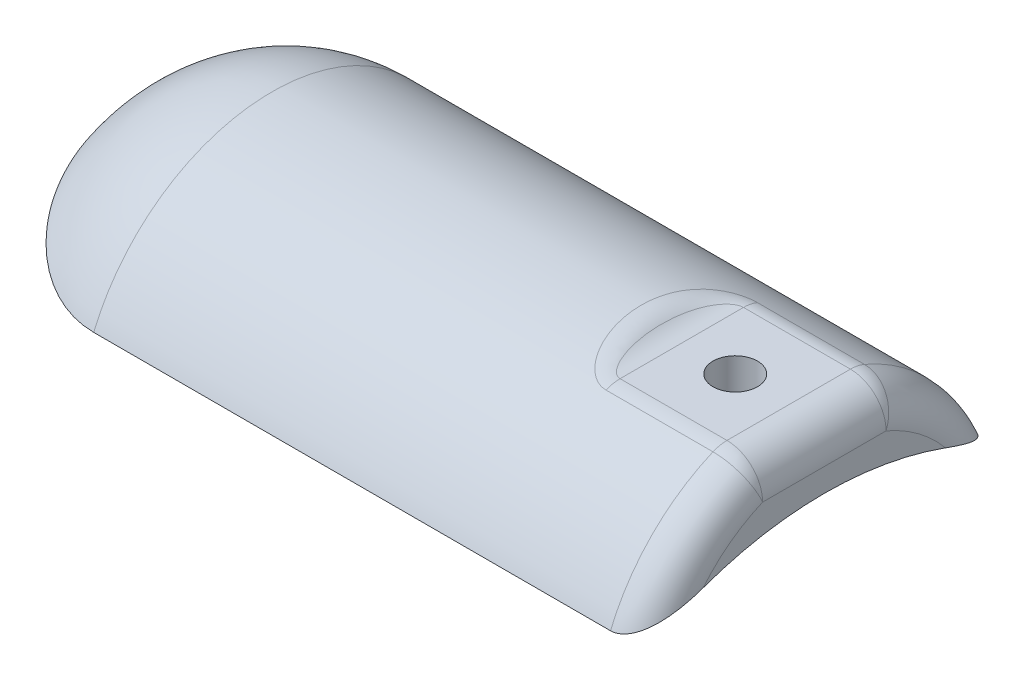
ISO-10303-21;
HEADER;
FILE_DESCRIPTION(('STEP AP214'),'2;1');
FILE_NAME('part.step','',(''),(''),'','','');
FILE_SCHEMA(('AUTOMOTIVE_DESIGN { 1 0 10303 214 1 1 1 1 }'));
ENDSEC;
DATA;
#1=APPLICATION_CONTEXT('core data for automotive mechanical design processes');
#2=APPLICATION_PROTOCOL_DEFINITION('international standard','automotive_design',2000,#1);
#3=PRODUCT_CONTEXT('',#1,'mechanical');
#4=PRODUCT('Part','Part','',(#3));
#5=PRODUCT_RELATED_PRODUCT_CATEGORY('part','',(#4));
#6=PRODUCT_DEFINITION_FORMATION('','',#4);
#7=PRODUCT_DEFINITION_CONTEXT('part definition',#1,'design');
#8=PRODUCT_DEFINITION('design','',#6,#7);
#9=PRODUCT_DEFINITION_SHAPE('','',#8);
#10=(LENGTH_UNIT() NAMED_UNIT(*) SI_UNIT(.MILLI.,.METRE.));
#11=(NAMED_UNIT(*) PLANE_ANGLE_UNIT() SI_UNIT($,.RADIAN.));
#12=(NAMED_UNIT(*) SI_UNIT($,.STERADIAN.) SOLID_ANGLE_UNIT());
#13=UNCERTAINTY_MEASURE_WITH_UNIT(LENGTH_MEASURE(1.E-05),#10,'distance_accuracy_value','');
#14=(GEOMETRIC_REPRESENTATION_CONTEXT(3) GLOBAL_UNCERTAINTY_ASSIGNED_CONTEXT((#13)) GLOBAL_UNIT_ASSIGNED_CONTEXT((#10,
#11,#12)) REPRESENTATION_CONTEXT('',''));
#15=CARTESIAN_POINT('',(0.,0.,0.));
#16=DIRECTION('',(0.,0.,1.));
#17=DIRECTION('',(1.,0.,0.));
#18=AXIS2_PLACEMENT_3D('',#15,#16,#17);
#19=CARTESIAN_POINT('',(50.8,-5.24015756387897,0.));
#20=DIRECTION('',(-1.,0.,0.));
#21=DIRECTION('',(0.,0.,1.));
#22=AXIS2_PLACEMENT_3D('',#19,#20,#21);
#23=CYLINDRICAL_SURFACE('',#22,13.738604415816);
#24=DIRECTION('',(-1.,0.,0.));
#25=VECTOR('',#24,1.);
#26=CARTESIAN_POINT('',(50.8,0.,-12.7));
#27=LINE('',#26,#25);
#28=CARTESIAN_POINT('',(48.26,0.,-12.7));
#29=VERTEX_POINT('',#28);
#30=CARTESIAN_POINT('',(11.43,0.,-12.7));
#31=VERTEX_POINT('',#30);
#32=EDGE_CURVE('E105',#29,#31,#27,.T.);
#33=ORIENTED_EDGE('',*,*,#32,.T.);
#34=CARTESIAN_POINT('',(11.43,-5.24015756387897,0.));
#35=DIRECTION('',(-1.,0.,0.));
#36=DIRECTION('',(0.,0.,1.));
#37=AXIS2_PLACEMENT_3D('',#34,#35,#36);
#38=CIRCLE('',#37,13.738604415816);
#39=CARTESIAN_POINT('',(11.43,0.,12.7));
#40=VERTEX_POINT('',#39);
#41=EDGE_CURVE('E50',#31,#40,#38,.F.);
#42=ORIENTED_EDGE('',*,*,#41,.T.);
#43=DIRECTION('',(-1.,0.,0.));
#44=VECTOR('',#43,1.);
#45=CARTESIAN_POINT('',(50.8,0.,12.7));
#46=LINE('',#45,#44);
#47=CARTESIAN_POINT('',(48.26,0.,12.7));
#48=VERTEX_POINT('',#47);
#49=EDGE_CURVE('E119',#48,#40,#46,.T.);
#50=ORIENTED_EDGE('',*,*,#49,.F.);
#51=CARTESIAN_POINT('',(48.26,-5.24015756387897,0.));
#52=DIRECTION('',(-1.,0.,0.));
#53=DIRECTION('',(0.,0.,1.));
#54=AXIS2_PLACEMENT_3D('',#51,#52,#53);
#55=CIRCLE('',#54,13.738604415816);
#56=CARTESIAN_POINT('',(48.26,7.39405058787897,5.39685423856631));
#57=VERTEX_POINT('',#56);
#58=EDGE_CURVE('E362',#48,#57,#55,.T.);
#59=ORIENTED_EDGE('',*,*,#58,.T.);
#60=DIRECTION('',(-1.,0.,0.));
#61=VECTOR('',#60,1.);
#62=CARTESIAN_POINT('',(50.8,7.39405058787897,5.39685423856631));
#63=LINE('',#62,#61);
#64=CARTESIAN_POINT('',(40.64,7.39405058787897,5.39685423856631));
#65=VERTEX_POINT('',#64);
#66=EDGE_CURVE('E360',#57,#65,#63,.T.);
#67=ORIENTED_EDGE('',*,*,#66,.T.);
#68=CARTESIAN_POINT('',(41.2903987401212,7.68291493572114,3.97930085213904));
#69=CARTESIAN_POINT('',(41.5991249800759,7.76469466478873,4.45344120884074));
#70=CARTESIAN_POINT('',(41.9407974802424,7.60183120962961,4.88186190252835));
#71=CARTESIAN_POINT('',(41.2657584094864,7.67638857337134,4.01363834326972));
#72=CARTESIAN_POINT('',(41.56303022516,7.75182008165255,4.49153952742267));
#73=CARTESIAN_POINT('',(41.8915168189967,7.58581794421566,4.92398761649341));
#74=CARTESIAN_POINT('',(41.240474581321,7.67008788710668,4.04627670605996));
#75=CARTESIAN_POINT('',(41.5259364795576,7.73939751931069,4.52775737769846));
#76=CARTESIAN_POINT('',(41.840949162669,7.57035840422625,4.96402881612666));
#77=CARTESIAN_POINT('',(41.1886477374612,7.65805118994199,4.10786107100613));
#78=CARTESIAN_POINT('',(41.449822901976,7.71568591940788,4.59607594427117));
#79=CARTESIAN_POINT('',(41.7372954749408,7.54082482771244,5.03958137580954));
#80=CARTESIAN_POINT('',(41.1621035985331,7.65231569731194,4.13680369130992));
#81=CARTESIAN_POINT('',(41.41079996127,7.70439643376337,4.6281776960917));
#82=CARTESIAN_POINT('',(41.6842071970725,7.52675206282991,5.07508858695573));
#83=CARTESIAN_POINT('',(41.0805979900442,7.63612607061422,4.21764930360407));
#84=CARTESIAN_POINT('',(41.2908994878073,7.67256253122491,4.7177997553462));
#85=CARTESIAN_POINT('',(41.5211959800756,7.48702874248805,5.17427111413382));
#86=CARTESIAN_POINT('',(41.0238487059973,7.62671213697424,4.26344928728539));
#87=CARTESIAN_POINT('',(41.207238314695,7.65407244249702,4.76857878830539));
#88=CARTESIAN_POINT('',(41.4076974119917,7.46393045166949,5.23045917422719));
#89=CARTESIAN_POINT('',(40.9130089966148,7.61239376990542,4.33231957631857));
#90=CARTESIAN_POINT('',(41.0436476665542,7.62598071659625,4.8448963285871));
#91=CARTESIAN_POINT('',(41.1860179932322,7.4287985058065,5.31495020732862));
#92=CARTESIAN_POINT('',(40.8592547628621,7.60712247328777,4.35725682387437));
#93=CARTESIAN_POINT('',(40.9642172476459,7.61564783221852,4.87252970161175));
#94=CARTESIAN_POINT('',(41.0785095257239,7.41586470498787,5.34554357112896));
#95=CARTESIAN_POINT('',(40.7503335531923,7.6000444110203,4.39062338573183));
#96=CARTESIAN_POINT('',(40.8032035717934,7.60178135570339,4.90948924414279));
#97=CARTESIAN_POINT('',(40.8606671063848,7.3984977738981,5.38647813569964));
#98=CARTESIAN_POINT('',(40.6951693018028,7.59823141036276,4.39908240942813));
#99=CARTESIAN_POINT('',(40.7215984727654,7.59823092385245,4.91886069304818));
#100=CARTESIAN_POINT('',(40.7503386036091,7.39404934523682,5.39685578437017));
#101=CARTESIAN_POINT('',(40.5815008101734,7.59823245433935,4.39907981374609));
#102=CARTESIAN_POINT('',(40.5534764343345,7.5982329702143,4.91885766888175));
#103=CARTESIAN_POINT('',(40.5230016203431,7.39405190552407,5.39685259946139));
#104=CARTESIAN_POINT('',(40.5229959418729,7.60027202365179,4.38956608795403));
#105=CARTESIAN_POINT('',(40.4669276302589,7.6022271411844,4.90831748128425));
#106=CARTESIAN_POINT('',(40.4059918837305,7.39905624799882,5.38518102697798));
#107=CARTESIAN_POINT('',(40.4077209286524,7.60821378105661,4.35209430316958));
#108=CARTESIAN_POINT('',(40.2965333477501,7.61778660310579,4.86681017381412));
#109=CARTESIAN_POINT('',(40.1754418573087,7.41854236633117,5.33921011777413));
#110=CARTESIAN_POINT('',(40.3509524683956,7.61411960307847,4.3241188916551));
#111=CARTESIAN_POINT('',(40.2126596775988,7.62936482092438,4.83580826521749));
#112=CARTESIAN_POINT('',(40.0619049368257,7.43303305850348,5.3048894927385));
#113=CARTESIAN_POINT('',(40.2409757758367,7.62915863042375,4.2515437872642));
#114=CARTESIAN_POINT('',(40.0503910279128,7.6588759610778,4.75538363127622));
#115=CARTESIAN_POINT('',(39.8419515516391,7.46993323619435,5.21585334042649));
#116=CARTESIAN_POINT('',(40.1877501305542,7.63827441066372,4.20703378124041));
#117=CARTESIAN_POINT('',(39.9719458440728,7.67678414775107,4.70603339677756));
#118=CARTESIAN_POINT('',(39.7355002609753,7.49229996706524,5.16124784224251));
#119=CARTESIAN_POINT('',(40.0854239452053,7.6589624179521,4.10348021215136));
#120=CARTESIAN_POINT('',(39.821405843,7.71748058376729,4.5912024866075));
#121=CARTESIAN_POINT('',(39.5308478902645,7.54306063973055,5.03420687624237));
#122=CARTESIAN_POINT('',(40.0363288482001,7.67053781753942,4.04441786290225));
#123=CARTESIAN_POINT('',(39.749305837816,7.74028563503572,4.52566889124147));
#124=CARTESIAN_POINT('',(39.4326576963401,7.57146236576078,4.96174836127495));
#125=CARTESIAN_POINT('',(39.9563621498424,7.69171925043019,3.9329806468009));
#126=CARTESIAN_POINT('',(39.6321446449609,7.78207661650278,4.40200704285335));
#127=CARTESIAN_POINT('',(39.2727242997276,7.62343372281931,4.82503562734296));
#128=CARTESIAN_POINT('',(39.9243210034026,7.70092923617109,3.88359677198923));
#129=CARTESIAN_POINT('',(39.5852688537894,7.80027407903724,4.34717201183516));
#130=CARTESIAN_POINT('',(39.2086420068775,7.64603160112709,4.76445079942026));
#131=CARTESIAN_POINT('',(39.8627003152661,7.7198765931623,3.7795261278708));
#132=CARTESIAN_POINT('',(39.4952730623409,7.83775923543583,4.23157616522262));
#133=CARTESIAN_POINT('',(39.0854006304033,7.69252136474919,4.63677547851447));
#134=CARTESIAN_POINT('',(39.8331185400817,7.7296134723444,3.72484426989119));
#135=CARTESIAN_POINT('',(39.4521498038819,7.85704848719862,4.17081035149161));
#136=CARTESIAN_POINT('',(39.026237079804,7.716412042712,4.56969101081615));
#137=CARTESIAN_POINT('',(39.7479027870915,7.75928474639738,3.55364257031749));
#138=CARTESIAN_POINT('',(39.3280937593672,7.91593996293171,3.98038919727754));
#139=CARTESIAN_POINT('',(38.8558055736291,7.78921430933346,4.35965837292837));
#140=CARTESIAN_POINT('',(39.6959085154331,7.77964890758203,3.43012481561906));
#141=CARTESIAN_POINT('',(39.2527784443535,7.95645276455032,3.84293383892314));
#142=CARTESIAN_POINT('',(38.7518170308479,7.83918038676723,4.20812506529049));
#143=CARTESIAN_POINT('',(39.581508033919,7.82813890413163,3.11557687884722));
#144=CARTESIAN_POINT('',(39.0876388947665,8.05323466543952,3.49244750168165));
#145=CARTESIAN_POINT('',(38.5230160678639,7.95815679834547,3.82223326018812));
#146=CARTESIAN_POINT('',(39.5237066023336,7.85598670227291,2.91777095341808));
#147=CARTESIAN_POINT('',(39.0049013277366,8.10901593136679,3.27182626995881));
#148=CARTESIAN_POINT('',(38.4074132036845,8.02648493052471,3.57956218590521));
#149=CARTESIAN_POINT('',(39.4239784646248,7.90752831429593,2.50475255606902));
#150=CARTESIAN_POINT('',(38.8628714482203,8.21264996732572,2.8105320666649));
#151=CARTESIAN_POINT('',(38.2079569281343,8.15294886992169,3.07286544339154));
#152=CARTESIAN_POINT('',(39.3820805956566,7.93121454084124,2.28950931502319));
#153=CARTESIAN_POINT('',(38.8037193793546,8.26044553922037,2.56984156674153));
#154=CARTESIAN_POINT('',(38.1241611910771,8.2110660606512,2.80880202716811));
#155=CARTESIAN_POINT('',(39.3227017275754,7.96634229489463,1.91585710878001));
#156=CARTESIAN_POINT('',(38.7202717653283,8.33153301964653,2.15156840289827));
#157=CARTESIAN_POINT('',(38.0054034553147,8.29725650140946,2.35040027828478));
#158=CARTESIAN_POINT('',(39.3016719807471,7.97931343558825,1.76019074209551));
#159=CARTESIAN_POINT('',(38.6908597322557,8.35784508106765,1.97712324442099));
#160=CARTESIAN_POINT('',(37.9633439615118,8.32908285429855,2.15942660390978));
#161=CARTESIAN_POINT('',(39.2656048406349,8.0020912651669,1.44513561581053));
#162=CARTESIAN_POINT('',(38.6405465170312,8.40413580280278,1.62374977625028));
#163=CARTESIAN_POINT('',(37.8912096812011,8.38497117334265,1.77291257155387));
#164=CARTESIAN_POINT('',(39.2505696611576,8.01189678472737,1.28574550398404));
#165=CARTESIAN_POINT('',(38.6196706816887,8.42409391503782,1.44488049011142));
#166=CARTESIAN_POINT('',(37.8611393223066,8.40903027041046,1.57737055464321));
#167=CARTESIAN_POINT('',(39.2260569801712,8.0281183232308,0.964496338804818));
#168=CARTESIAN_POINT('',(38.5856909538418,8.45715751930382,1.08410847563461));
#169=CARTESIAN_POINT('',(37.8121139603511,8.44883189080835,1.18325758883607));
#170=CARTESIAN_POINT('',(39.2165832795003,8.03453202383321,0.802635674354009));
#171=CARTESIAN_POINT('',(38.5726081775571,8.47024371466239,0.902279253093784));
#172=CARTESIAN_POINT('',(37.7931665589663,8.46456872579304,0.984684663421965));
#173=CARTESIAN_POINT('',(39.2029250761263,8.0438384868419,0.477549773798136));
#174=CARTESIAN_POINT('',(38.5537564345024,8.48924941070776,0.536891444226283));
#175=CARTESIAN_POINT('',(37.7658501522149,8.48740332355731,0.585864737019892));
#176=CARTESIAN_POINT('',(39.1987431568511,8.04672952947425,0.314323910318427));
#177=CARTESIAN_POINT('',(38.5480000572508,8.4951564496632,0.353416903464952));
#178=CARTESIAN_POINT('',(37.757486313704,8.49449686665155,0.385616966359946));
#179=CARTESIAN_POINT('',(39.1955223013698,8.04895253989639,-0.0154952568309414));
#180=CARTESIAN_POINT('',(38.5435632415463,8.49970029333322,-0.0174347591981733));
#181=CARTESIAN_POINT('',(37.7510446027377,8.49995130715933,-0.0190097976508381));
#182=CARTESIAN_POINT('',(39.1965814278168,8.04821664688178,-0.182094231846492));
#183=CARTESIAN_POINT('',(38.5450199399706,8.49819620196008,-0.204726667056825));
#184=CARTESIAN_POINT('',(37.7531628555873,8.49814569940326,-0.223395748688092));
#185=CARTESIAN_POINT('',(39.2040995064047,8.04304447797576,-0.514499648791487));
#186=CARTESIAN_POINT('',(38.5553814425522,8.48762666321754,-0.578448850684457));
#187=CARTESIAN_POINT('',(37.7681990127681,8.48545512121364,-0.631195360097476));
#188=CARTESIAN_POINT('',(39.2105559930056,8.03860989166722,-0.680306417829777));
#189=CARTESIAN_POINT('',(38.5642776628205,8.47856994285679,-0.764786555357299));
#190=CARTESIAN_POINT('',(37.7811119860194,8.47457429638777,-0.834609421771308));
#191=CARTESIAN_POINT('',(39.2290591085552,8.02613058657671,-1.01002907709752));
#192=CARTESIAN_POINT('',(38.5898560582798,8.45310220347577,-1.1352746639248));
#193=CARTESIAN_POINT('',(37.8181182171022,8.44395472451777,-1.23911778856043));
#194=CARTESIAN_POINT('',(39.2411020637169,8.0180882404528,-1.17394613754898));
#195=CARTESIAN_POINT('',(38.6065205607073,8.43670818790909,-1.31934034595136));
#196=CARTESIAN_POINT('',(37.8422041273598,8.42422179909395,-1.44021352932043));
#197=CARTESIAN_POINT('',(39.2711390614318,7.99857385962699,-1.49869104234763));
#198=CARTESIAN_POINT('',(38.6482651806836,8.39697967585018,-1.68385370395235));
#199=CARTESIAN_POINT('',(37.9022781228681,8.37634076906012,-1.83861511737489));
#200=CARTESIAN_POINT('',(39.2891310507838,7.98710300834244,-1.65951993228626));
#201=CARTESIAN_POINT('',(38.6733226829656,8.37366496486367,-1.86422926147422));
#202=CARTESIAN_POINT('',(37.9382621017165,8.34819556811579,-2.03592224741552));
#203=CARTESIAN_POINT('',(39.3409199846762,7.9552742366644,-2.04633045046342));
#204=CARTESIAN_POINT('',(38.745786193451,8.30911063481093,-2.29763226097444));
#205=CARTESIAN_POINT('',(38.0418399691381,8.27009960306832,-2.51046679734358));
#206=CARTESIAN_POINT('',(39.3781878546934,7.93322469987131,-2.26997501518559));
#207=CARTESIAN_POINT('',(38.7981445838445,8.2645108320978,-2.5479432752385));
#208=CARTESIAN_POINT('',(38.1163757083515,8.21599824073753,-2.78483707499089));
#209=CARTESIAN_POINT('',(39.4682988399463,7.88404492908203,-2.70191219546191));
#210=CARTESIAN_POINT('',(38.9258725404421,8.16536770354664,-3.03084607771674));
#211=CARTESIAN_POINT('',(38.2965976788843,8.09532938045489,-3.31474364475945));
#212=CARTESIAN_POINT('',(39.5211162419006,7.85692310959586,-2.9102294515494));
#213=CARTESIAN_POINT('',(39.0011047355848,8.11089432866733,-3.26340357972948));
#214=CARTESIAN_POINT('',(38.402232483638,8.02878252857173,-3.57031016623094));
#215=CARTESIAN_POINT('',(39.6274989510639,7.8082516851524,-3.24740084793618));
#216=CARTESIAN_POINT('',(39.1539998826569,8.01348483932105,-3.63945319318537));
#217=CARTESIAN_POINT('',(38.6149979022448,7.90936096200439,-3.98395674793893));
#218=CARTESIAN_POINT('',(39.6766466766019,7.78728959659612,-3.38208936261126));
#219=CARTESIAN_POINT('',(39.2248920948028,7.97167165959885,-3.78946682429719));
#220=CARTESIAN_POINT('',(38.7132933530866,7.85792779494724,-4.14919450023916));
#221=CARTESIAN_POINT('',(39.7579458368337,7.75612830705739,-3.57103614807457));
#222=CARTESIAN_POINT('',(39.342818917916,7.9096640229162,-3.99980408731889));
#223=CARTESIAN_POINT('',(38.8758916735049,7.781469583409,-4.3809970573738));
#224=CARTESIAN_POINT('',(39.7862878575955,7.74579473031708,-3.63180257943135));
#225=CARTESIAN_POINT('',(39.3839909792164,7.88914260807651,-4.06738283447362));
#226=CARTESIAN_POINT('',(38.9325757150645,7.75611483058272,-4.45554616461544));
#227=CARTESIAN_POINT('',(39.8455978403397,7.72545118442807,-3.74838278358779));
#228=CARTESIAN_POINT('',(39.4703324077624,7.8488008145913,-4.19696740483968));
#229=CARTESIAN_POINT('',(39.0511956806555,7.70619933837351,-4.59856838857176));
#230=CARTESIAN_POINT('',(39.8765690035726,7.71544163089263,-3.80419034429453));
#231=CARTESIAN_POINT('',(39.5155050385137,7.82897928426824,-4.25897644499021));
#232=CARTESIAN_POINT('',(39.1131380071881,7.68163961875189,-4.66703388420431));
#233=CARTESIAN_POINT('',(39.9591897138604,7.69060961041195,-3.93955739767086));
#234=CARTESIAN_POINT('',(39.6362082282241,7.77988716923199,-4.40927254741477));
#235=CARTESIAN_POINT('',(39.2783794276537,7.62071107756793,-4.83310407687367));
#236=CARTESIAN_POINT('',(40.0127215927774,7.67622405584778,-4.01495823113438));
#237=CARTESIAN_POINT('',(39.7146482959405,7.75149668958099,-4.49297805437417));
#238=CARTESIAN_POINT('',(39.3854431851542,7.58541427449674,-4.9256068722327));
#239=CARTESIAN_POINT('',(40.1255814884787,7.65019652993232,-4.14796668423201));
#240=CARTESIAN_POINT('',(39.880412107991,7.70022802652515,-4.64052697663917));
#241=CARTESIAN_POINT('',(39.6111629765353,7.52155240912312,-5.08878350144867));
#242=CARTESIAN_POINT('',(40.1848997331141,7.63855004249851,-4.20560364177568));
#243=CARTESIAN_POINT('',(39.9677349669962,7.67732560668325,-4.70445200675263));
#244=CARTESIAN_POINT('',(39.7297994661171,7.49297626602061,-5.15949332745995));
#245=CARTESIAN_POINT('',(40.308875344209,7.6191240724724,-4.30026114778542));
#246=CARTESIAN_POINT('',(40.1505182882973,7.63918090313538,-4.80936516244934));
#247=CARTESIAN_POINT('',(39.9777506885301,7.44531216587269,-5.27562047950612));
#248=CARTESIAN_POINT('',(40.373576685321,7.61138103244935,-4.33708778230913));
#249=CARTESIAN_POINT('',(40.2460778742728,7.62399508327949,-4.85018258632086));
#250=CARTESIAN_POINT('',(40.1071533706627,7.42631362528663,-5.32079990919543));
#251=CARTESIAN_POINT('',(40.4725123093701,7.60354205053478,-4.37415315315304));
#252=CARTESIAN_POINT('',(40.3923088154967,7.60863234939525,-4.89124746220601));
#253=CARTESIAN_POINT('',(40.3050246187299,7.40707967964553,-5.36627222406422));
#254=CARTESIAN_POINT('',(40.5058015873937,7.6015583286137,-4.38347915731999));
#255=CARTESIAN_POINT('',(40.4415290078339,7.60474643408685,-4.90157829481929));
#256=CARTESIAN_POINT('',(40.3716031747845,7.40221236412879,-5.37771349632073));
#257=CARTESIAN_POINT('',(40.5727215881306,7.59890244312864,-4.39594564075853));
#258=CARTESIAN_POINT('',(40.5404880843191,7.59954494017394,-4.91538614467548));
#259=CARTESIAN_POINT('',(40.505443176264,7.39569580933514,-5.39300755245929));
#260=CARTESIAN_POINT('',(40.6063522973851,7.59823022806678,-4.39908636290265));
#261=CARTESIAN_POINT('',(40.5902331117,7.59822860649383,-4.9188651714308));
#262=CARTESIAN_POINT('',(40.5727045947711,7.39404644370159,-5.39686063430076));
#263=CARTESIAN_POINT('',(40.6984500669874,7.59823485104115,-4.39907209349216));
#264=CARTESIAN_POINT('',(40.7264510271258,7.59823766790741,-4.91884889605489));
#265=CARTESIAN_POINT('',(40.7569001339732,7.39405778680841,-5.39684312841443));
#266=CARTESIAN_POINT('',(40.7569514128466,7.60027134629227,-4.38956991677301));
#267=CARTESIAN_POINT('',(40.8129944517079,7.60222581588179,-4.9083216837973));
#268=CARTESIAN_POINT('',(40.8739028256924,7.39905458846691,-5.38518572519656));
#269=CARTESIAN_POINT('',(40.8722385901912,7.60820803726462,-4.35212075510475));
#270=CARTESIAN_POINT('',(40.9834068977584,7.61777534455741,-4.8668395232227));
#271=CARTESIAN_POINT('',(41.1044771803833,7.41852827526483,-5.33924257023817));
#272=CARTESIAN_POINT('',(40.9290212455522,7.61411497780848,-4.32414157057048));
#273=CARTESIAN_POINT('',(41.0673017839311,7.62935574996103,-4.83583334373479));
#274=CARTESIAN_POINT('',(41.2180424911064,7.43302170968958,-5.30491731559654));
#275=CARTESIAN_POINT('',(41.0391672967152,7.62917922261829,-4.25144405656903));
#276=CARTESIAN_POINT('',(41.2298200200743,7.65891640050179,-4.75527306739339));
#277=CARTESIAN_POINT('',(41.4383345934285,7.46998376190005,-5.21573098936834));
#278=CARTESIAN_POINT('',(41.0925411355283,7.63832597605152,-4.20678003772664));
#279=CARTESIAN_POINT('',(41.3084829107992,7.67688550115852,-4.70575209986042));
#280=CARTESIAN_POINT('',(41.54508227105,7.49242649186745,-5.16093654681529));
#281=CARTESIAN_POINT('',(41.1693116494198,7.6538582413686,-4.12902691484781));
#282=CARTESIAN_POINT('',(41.4213965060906,7.70743208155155,-4.61955344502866));
#283=CARTESIAN_POINT('',(41.6986232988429,7.53053689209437,-5.06554792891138));
#284=CARTESIAN_POINT('',(41.1943206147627,7.65932873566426,-4.10136273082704));
#285=CARTESIAN_POINT('',(41.4581566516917,7.71820133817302,-4.58886875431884));
#286=CARTESIAN_POINT('',(41.7486412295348,7.54395944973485,-5.03160912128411));
#287=CARTESIAN_POINT('',(41.243211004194,7.67077072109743,-4.04273773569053));
#288=CARTESIAN_POINT('',(41.5299496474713,7.74074342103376,-4.52383151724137));
#289=CARTESIAN_POINT('',(41.846422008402,7.57203382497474,-4.95968715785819));
#290=CARTESIAN_POINT('',(41.2670931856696,7.67674186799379,-4.01177918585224));
#291=CARTESIAN_POINT('',(41.5649847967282,7.7525168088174,-4.48947743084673));
#292=CARTESIAN_POINT('',(41.8941863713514,7.58668479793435,-4.92170677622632));
#293=CARTESIAN_POINT('',(41.2903987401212,7.68291493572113,-3.9793008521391));
#294=CARTESIAN_POINT('',(41.5991249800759,7.76469466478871,-4.4534412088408));
#295=CARTESIAN_POINT('',(41.9407974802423,7.60183120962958,-4.88186190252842));
#296=(BOUNDED_SURFACE() B_SPLINE_SURFACE(3,2,((#68,#69,#70),(#71,#72,#73),(#74,#75,#76),(#77,
#78,#79),(#80,#81,#82),(#83,#84,#85),(#86,#87,#88),(#89,#90,#91),(#92,#93,#94),(#95,#96,#97),
(#98,#99,#100),(#101,#102,#103),(#104,#105,#106),(#107,#108,#109),(#110,#111,#112),(#113,#114,
#115),(#116,#117,#118),(#119,#120,#121),(#122,#123,#124),(#125,#126,#127),(#128,#129,#130),
(#131,#132,#133),(#134,#135,#136),(#137,#138,#139),(#140,#141,#142),(#143,#144,#145),(#146,#147,
#148),(#149,#150,#151),(#152,#153,#154),(#155,#156,#157),(#158,#159,#160),(#161,#162,#163),
(#164,#165,#166),(#167,#168,#169),(#170,#171,#172),(#173,#174,#175),(#176,#177,#178),(#179,#180,
#181),(#182,#183,#184),(#185,#186,#187),(#188,#189,#190),(#191,#192,#193),(#194,#195,#196),
(#197,#198,#199),(#200,#201,#202),(#203,#204,#205),(#206,#207,#208),(#209,#210,#211),(#212,#213,
#214),(#215,#216,#217),(#218,#219,#220),(#221,#222,#223),(#224,#225,#226),(#227,#228,#229),
(#230,#231,#232),(#233,#234,#235),(#236,#237,#238),(#239,#240,#241),(#242,#243,#244),(#245,#246,
#247),(#248,#249,#250),(#251,#252,#253),(#254,#255,#256),(#257,#258,#259),(#260,#261,#262),
(#263,#264,#265),(#266,#267,#268),(#269,#270,#271),(#272,#273,#274),(#275,#276,#277),(#278,#279,
#280),(#281,#282,#283),(#284,#285,#286),(#287,#288,#289),(#290,#291,#292),(#293,#294,#295)),
.UNSPECIFIED.,.F.,.F.,.F.) B_SPLINE_SURFACE_WITH_KNOTS((4,2,2,2,2,2,2,2,2,2,2,2,2,2,2,2,2,2,2,2,
2,2,2,2,2,2,2,2,2,2,2,2,2,2,2,2,2,4),(3,3),(0.,0.184321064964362,0.368809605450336,
0.738422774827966,1.06964015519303,1.40025981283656,1.75083488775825,2.10173994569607,
2.45076877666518,2.80025056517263,3.04885024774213,3.29722163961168,3.79478810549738,
4.49840364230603,5.20328898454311,5.69267372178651,6.18223902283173,6.67213851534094,
7.16227708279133,7.66162068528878,8.16073630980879,8.65952416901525,9.1581400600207,
9.87528069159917,10.5912420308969,11.1051517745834,11.3617772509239,11.6187198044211,
12.0192745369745,12.4191641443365,12.822721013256,13.0244617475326,13.2261945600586,
13.5766284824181,13.927674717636,14.277588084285,14.452055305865,14.6264035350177),(0.,1.),
.UNSPECIFIED.) GEOMETRIC_REPRESENTATION_ITEM() RATIONAL_B_SPLINE_SURFACE(((1.,0.975595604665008,
1.),(1.,0.975922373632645,1.),(1.,0.976235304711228,1.),(1.,0.976829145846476,1.),(1.,
0.977110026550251,1.),(1.,0.977898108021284,1.),(1.,0.978349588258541,1.),(1.,0.97903139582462,
1.),(1.,0.979279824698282,1.),(1.,0.979612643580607,1.),(1.,0.979697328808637,1.),(1.,
0.979697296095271,1.),(1.,0.979602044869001,1.),(1.,0.97922839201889,1.),(1.,0.97894981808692,
1.),(1.,0.978232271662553,1.),(1.,0.977794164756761,1.),(1.,0.976785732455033,1.),(1.,
0.976215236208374,1.),(1.,0.975154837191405,1.),(1.,0.974689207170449,1.),(1.,0.97372049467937,
1.),(1.,0.973217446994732,1.),(1.,0.971666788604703,1.),(1.,0.970579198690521,1.),(1.,
0.967930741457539,1.),(1.,0.966360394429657,1.),(1.,0.963378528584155,1.),(1.,0.961967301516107,
1.),(1.,0.959835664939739,1.),(1.,0.959035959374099,1.),(1.,0.957617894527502,1.),(1.,
0.956999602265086,1.),(1.,0.955970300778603,1.),(1.,0.955559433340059,1.),(1.,0.954961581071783,
1.),(1.,0.954774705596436,1.),(1.,0.954631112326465,1.),(1.,0.954678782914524,1.),(1.,
0.955012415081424,1.),(1.,0.955298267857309,1.),(1.,0.956096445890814,1.),(1.,0.956608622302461,
1.),(1.,0.957837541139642,1.),(1.,0.958554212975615,1.),(1.,0.96051421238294,1.),(1.,
0.961850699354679,1.),(1.,0.964748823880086,1.),(1.,0.966310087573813,1.),(1.,0.969023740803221,
1.),(1.,0.970167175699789,1.),(1.,0.971828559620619,1.),(1.,0.972373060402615,1.),(1.,
0.973433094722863,1.),(1.,0.973948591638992,1.),(1.,0.975213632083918,1.),(1.,0.975932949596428,
1.),(1.,0.977216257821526,1.),(1.,0.977780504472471,1.),(1.,0.978712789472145,1.),(1.,
0.979078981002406,1.),(1.,0.979448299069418,1.),(1.,0.979541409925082,1.),(1.,0.979665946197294,
1.),(1.,0.9796973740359,1.),(1.,0.979697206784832,1.),(1.,0.979602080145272,1.),(1.,
0.979228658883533,1.),(1.,0.978950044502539,1.),(1.,0.978231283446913,1.),(1.,0.977791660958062,
1.),(1.,0.977034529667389,1.),(1.,0.976766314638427,1.),(1.,0.976201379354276,1.),(1.,
0.975904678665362,1.),(1.,0.975595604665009,1.))) REPRESENTATION_ITEM('') SURFACE());
#297=CARTESIAN_POINT('',(41.9407974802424,7.60183120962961,4.88186190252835));
#298=CARTESIAN_POINT('',(41.8915168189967,7.58581794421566,4.92398761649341));
#299=CARTESIAN_POINT('',(41.840949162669,7.57035840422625,4.96402881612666));
#300=CARTESIAN_POINT('',(41.7372954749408,7.54082482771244,5.03958137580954));
#301=CARTESIAN_POINT('',(41.6842071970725,7.52675206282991,5.07508858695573));
#302=CARTESIAN_POINT('',(41.5211959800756,7.48702874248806,5.17427111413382));
#303=CARTESIAN_POINT('',(41.4076974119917,7.46393045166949,5.23045917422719));
#304=CARTESIAN_POINT('',(41.1860179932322,7.4287985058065,5.31495020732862));
#305=CARTESIAN_POINT('',(41.0785095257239,7.41586470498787,5.34554357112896));
#306=CARTESIAN_POINT('',(40.8606671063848,7.3984977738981,5.38647813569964));
#307=CARTESIAN_POINT('',(40.7503386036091,7.39404934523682,5.39685578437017));
#308=CARTESIAN_POINT('',(40.5230016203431,7.39405190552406,5.39685259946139));
#309=CARTESIAN_POINT('',(40.4059918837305,7.39905624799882,5.38518102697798));
#310=CARTESIAN_POINT('',(40.1754418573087,7.41854236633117,5.33921011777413));
#311=CARTESIAN_POINT('',(40.0619049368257,7.43303305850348,5.3048894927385));
#312=CARTESIAN_POINT('',(39.8419515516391,7.46993323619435,5.21585334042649));
#313=CARTESIAN_POINT('',(39.7355002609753,7.49229996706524,5.16124784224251));
#314=CARTESIAN_POINT('',(39.5308478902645,7.54306063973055,5.03420687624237));
#315=CARTESIAN_POINT('',(39.4326576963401,7.57146236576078,4.96174836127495));
#316=CARTESIAN_POINT('',(39.2727242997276,7.62343372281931,4.82503562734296));
#317=CARTESIAN_POINT('',(39.2086420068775,7.64603160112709,4.76445079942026));
#318=CARTESIAN_POINT('',(39.0854006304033,7.69252136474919,4.63677547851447));
#319=CARTESIAN_POINT('',(39.026237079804,7.716412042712,4.56969101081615));
#320=CARTESIAN_POINT('',(38.8558055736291,7.78921430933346,4.35965837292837));
#321=CARTESIAN_POINT('',(38.7518170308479,7.83918038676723,4.20812506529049));
#322=CARTESIAN_POINT('',(38.5230160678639,7.95815679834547,3.82223326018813));
#323=CARTESIAN_POINT('',(38.4074132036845,8.02648493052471,3.57956218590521));
#324=CARTESIAN_POINT('',(38.2079569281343,8.15294886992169,3.07286544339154));
#325=CARTESIAN_POINT('',(38.1241611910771,8.2110660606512,2.80880202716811));
#326=CARTESIAN_POINT('',(38.0054034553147,8.29725650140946,2.35040027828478));
#327=CARTESIAN_POINT('',(37.9633439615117,8.32908285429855,2.15942660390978));
#328=CARTESIAN_POINT('',(37.8912096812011,8.38497117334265,1.77291257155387));
#329=CARTESIAN_POINT('',(37.8611393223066,8.40903027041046,1.57737055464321));
#330=CARTESIAN_POINT('',(37.8121139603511,8.44883189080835,1.18325758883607));
#331=CARTESIAN_POINT('',(37.7931665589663,8.46456872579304,0.984684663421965));
#332=CARTESIAN_POINT('',(37.7658501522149,8.48740332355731,0.585864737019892));
#333=CARTESIAN_POINT('',(37.757486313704,8.49449686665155,0.385616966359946));
#334=CARTESIAN_POINT('',(37.7510446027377,8.49995130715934,-0.0190097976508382));
#335=CARTESIAN_POINT('',(37.7531628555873,8.49814569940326,-0.223395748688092));
#336=CARTESIAN_POINT('',(37.7681990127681,8.48545512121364,-0.631195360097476));
#337=CARTESIAN_POINT('',(37.7811119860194,8.47457429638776,-0.834609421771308));
#338=CARTESIAN_POINT('',(37.8181182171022,8.44395472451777,-1.23911778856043));
#339=CARTESIAN_POINT('',(37.8422041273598,8.42422179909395,-1.44021352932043));
#340=CARTESIAN_POINT('',(37.9022781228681,8.37634076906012,-1.83861511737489));
#341=CARTESIAN_POINT('',(37.9382621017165,8.34819556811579,-2.03592224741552));
#342=CARTESIAN_POINT('',(38.0418399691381,8.27009960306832,-2.51046679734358));
#343=CARTESIAN_POINT('',(38.1163757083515,8.21599824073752,-2.78483707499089));
#344=CARTESIAN_POINT('',(38.2965976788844,8.09532938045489,-3.31474364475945));
#345=CARTESIAN_POINT('',(38.402232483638,8.02878252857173,-3.57031016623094));
#346=CARTESIAN_POINT('',(38.6149979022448,7.90936096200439,-3.98395674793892));
#347=CARTESIAN_POINT('',(38.7132933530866,7.85792779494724,-4.14919450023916));
#348=CARTESIAN_POINT('',(38.8758916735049,7.781469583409,-4.3809970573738));
#349=CARTESIAN_POINT('',(38.9325757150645,7.75611483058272,-4.45554616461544));
#350=CARTESIAN_POINT('',(39.0511956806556,7.70619933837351,-4.59856838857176));
#351=CARTESIAN_POINT('',(39.1131380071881,7.68163961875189,-4.66703388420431));
#352=CARTESIAN_POINT('',(39.2783794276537,7.62071107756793,-4.83310407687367));
#353=CARTESIAN_POINT('',(39.3854431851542,7.58541427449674,-4.9256068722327));
#354=CARTESIAN_POINT('',(39.6111629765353,7.52155240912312,-5.08878350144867));
#355=CARTESIAN_POINT('',(39.7297994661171,7.49297626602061,-5.15949332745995));
#356=CARTESIAN_POINT('',(39.9777506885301,7.44531216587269,-5.27562047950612));
#357=CARTESIAN_POINT('',(40.1071533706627,7.42631362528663,-5.32079990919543));
#358=CARTESIAN_POINT('',(40.3050246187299,7.40707967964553,-5.36627222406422));
#359=CARTESIAN_POINT('',(40.3716031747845,7.40221236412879,-5.37771349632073));
#360=CARTESIAN_POINT('',(40.505443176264,7.39569580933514,-5.39300755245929));
#361=CARTESIAN_POINT('',(40.5727045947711,7.39404644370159,-5.39686063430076));
#362=CARTESIAN_POINT('',(40.7569001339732,7.39405778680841,-5.39684312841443));
#363=CARTESIAN_POINT('',(40.8739028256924,7.39905458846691,-5.38518572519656));
#364=CARTESIAN_POINT('',(41.1044771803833,7.41852827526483,-5.33924257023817));
#365=CARTESIAN_POINT('',(41.2180424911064,7.43302170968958,-5.30491731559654));
#366=CARTESIAN_POINT('',(41.4383345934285,7.46998376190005,-5.21573098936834));
#367=CARTESIAN_POINT('',(41.54508227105,7.49242649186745,-5.16093654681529));
#368=CARTESIAN_POINT('',(41.6986232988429,7.53053689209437,-5.06554792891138));
#369=CARTESIAN_POINT('',(41.7486412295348,7.54395944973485,-5.03160912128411));
#370=CARTESIAN_POINT('',(41.846422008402,7.57203382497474,-4.9596871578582));
#371=CARTESIAN_POINT('',(41.8941863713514,7.58668479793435,-4.92170677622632));
#372=CARTESIAN_POINT('',(41.9407974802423,7.60183120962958,-4.88186190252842));
#373=B_SPLINE_CURVE_WITH_KNOTS('',3,(#297,#298,#299,#300,#301,#302,#303,#304,#305,#306,#307,
#308,#309,#310,#311,#312,#313,#314,#315,#316,#317,#318,#319,#320,#321,#322,#323,#324,#325,#326,
#327,#328,#329,#330,#331,#332,#333,#334,#335,#336,#337,#338,#339,#340,#341,#342,#343,#344,#345,
#346,#347,#348,#349,#350,#351,#352,#353,#354,#355,#356,#357,#358,#359,#360,#361,#362,#363,#364,
#365,#366,#367,#368,#369,#370,#371,#372),.UNSPECIFIED.,.F.,.F.,(4,2,2,2,2,2,2,2,2,2,2,2,2,2,2,2,
2,2,2,2,2,2,2,2,2,2,2,2,2,2,2,2,2,2,2,2,2,4),(0.,0.184321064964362,0.368809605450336,
0.738422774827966,1.06964015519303,1.40025981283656,1.75083488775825,2.10173994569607,
2.45076877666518,2.80025056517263,3.04885024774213,3.29722163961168,3.79478810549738,
4.49840364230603,5.20328898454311,5.69267372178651,6.18223902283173,6.67213851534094,
7.16227708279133,7.66162068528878,8.16073630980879,8.65952416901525,9.1581400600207,
9.87528069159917,10.5912420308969,11.1051517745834,11.3617772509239,11.6187198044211,
12.0192745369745,12.4191641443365,12.822721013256,13.0244617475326,13.2261945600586,
13.5766284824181,13.927674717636,14.277588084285,14.452055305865,14.6264035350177),.UNSPECIFIED.);
#374=CARTESIAN_POINT('',(40.64,7.39405058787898,-5.3968542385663));
#375=VERTEX_POINT('',#374);
#376=EDGE_CURVE('E365',#65,#375,#373,.T.);
#377=ORIENTED_EDGE('',*,*,#376,.T.);
#378=DIRECTION('',(-1.,0.,0.));
#379=VECTOR('',#378,1.);
#380=CARTESIAN_POINT('',(50.8,7.39405058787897,-5.39685423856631));
#381=LINE('',#380,#379);
#382=CARTESIAN_POINT('',(48.26,7.39405058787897,-5.39685423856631));
#383=VERTEX_POINT('',#382);
#384=EDGE_CURVE('E108',#375,#383,#381,.F.);
#385=ORIENTED_EDGE('',*,*,#384,.T.);
#386=CARTESIAN_POINT('',(48.26,-5.24015756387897,0.));
#387=DIRECTION('',(-1.,0.,0.));
#388=DIRECTION('',(0.,0.,1.));
#389=AXIS2_PLACEMENT_3D('',#386,#387,#388);
#390=CIRCLE('',#389,13.738604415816);
#391=EDGE_CURVE('E104',#383,#29,#390,.T.);
#392=ORIENTED_EDGE('',*,*,#391,.T.);
#393=EDGE_LOOP('',(#33,#42,#50,#59,#67,#377,#385,#392));
#394=FACE_BOUND('',#393,.T.);
#395=ADVANCED_FACE('F36',(#394),#23,.T.);
#396=CARTESIAN_POINT('',(50.8,-21.9970452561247,0.));
#397=DIRECTION('',(-1.,0.,0.));
#398=DIRECTION('',(0.,0.,1.));
#399=AXIS2_PLACEMENT_3D('',#396,#397,#398);
#400=CYLINDRICAL_SURFACE('',#399,25.4);
#401=CARTESIAN_POINT('',(44.45,3.35329682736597,1.5875));
#402=CARTESIAN_POINT('',(44.539077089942,3.35329749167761,1.58749608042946));
#403=CARTESIAN_POINT('',(44.6282165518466,3.35377138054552,1.57997742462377));
#404=CARTESIAN_POINT('',(44.8040341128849,3.35561595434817,1.55009194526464));
#405=CARTESIAN_POINT('',(44.8907092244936,3.35698768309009,1.52770783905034));
#406=CARTESIAN_POINT('',(45.0590258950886,3.36047195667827,1.46873691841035));
#407=CARTESIAN_POINT('',(45.1406700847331,3.36258411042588,1.43215760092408));
#408=CARTESIAN_POINT('',(45.2966382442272,3.3673107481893,1.34584673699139));
#409=CARTESIAN_POINT('',(45.3709638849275,3.36992511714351,1.29611820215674));
#410=CARTESIAN_POINT('',(45.5103181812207,3.37536605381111,1.18483854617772));
#411=CARTESIAN_POINT('',(45.5753343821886,3.37819289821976,1.12327184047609));
#412=CARTESIAN_POINT('',(45.6941176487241,3.38373768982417,0.990095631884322));
#413=CARTESIAN_POINT('',(45.7478842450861,3.38645563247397,0.918485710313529));
#414=CARTESIAN_POINT('',(45.8426800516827,3.39147874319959,0.767185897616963));
#415=CARTESIAN_POINT('',(45.8836990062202,3.3937835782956,0.687489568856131));
#416=CARTESIAN_POINT('',(45.9517694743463,3.39771786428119,0.522324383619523));
#417=CARTESIAN_POINT('',(45.9788211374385,3.39934732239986,0.436855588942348));
#418=CARTESIAN_POINT('',(46.0181547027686,3.40174534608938,0.262691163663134));
#419=CARTESIAN_POINT('',(46.030456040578,3.40251504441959,0.173999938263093));
#420=CARTESIAN_POINT('',(46.0399997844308,3.40311063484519,-0.00419162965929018));
#421=CARTESIAN_POINT('',(46.0372423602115,3.40293653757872,-0.0936919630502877));
#422=CARTESIAN_POINT('',(46.0167628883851,3.40166509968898,-0.270829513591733));
#423=CARTESIAN_POINT('',(45.9990617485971,3.40056904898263,-0.358469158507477));
#424=CARTESIAN_POINT('',(45.9492297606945,3.39757858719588,-0.529530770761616));
#425=CARTESIAN_POINT('',(45.9170988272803,3.39568417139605,-0.612952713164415));
#426=CARTESIAN_POINT('',(45.8392956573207,3.39130805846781,-0.773277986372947));
#427=CARTESIAN_POINT('',(45.7936139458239,3.38882595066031,-0.850176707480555));
#428=CARTESIAN_POINT('',(45.6900128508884,3.38355379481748,-0.995222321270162));
#429=CARTESIAN_POINT('',(45.6320933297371,3.38076374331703,-1.06336911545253));
#430=CARTESIAN_POINT('',(45.5055426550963,3.37518406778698,-1.18909846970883));
#431=CARTESIAN_POINT('',(45.43689335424,3.3723944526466,-1.24666276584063));
#432=CARTESIAN_POINT('',(45.2908954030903,3.36713492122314,-1.34945226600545));
#433=CARTESIAN_POINT('',(45.213546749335,3.36466500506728,-1.39467746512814));
#434=CARTESIAN_POINT('',(45.0523341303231,3.36032378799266,-1.47150369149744));
#435=CARTESIAN_POINT('',(44.9684697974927,3.35845252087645,-1.50310394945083));
#436=CARTESIAN_POINT('',(44.796611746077,3.35552083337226,-1.55177066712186));
#437=CARTESIAN_POINT('',(44.708618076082,3.35446040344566,-1.56883729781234));
#438=CARTESIAN_POINT('',(44.5311584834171,3.35327176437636,-1.58792954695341));
#439=CARTESIAN_POINT('',(44.4416953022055,3.35314198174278,-1.58998055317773));
#440=CARTESIAN_POINT('',(44.2636961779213,3.3538251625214,-1.57904966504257));
#441=CARTESIAN_POINT('',(44.1751602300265,3.35463812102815,-1.56606784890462));
#442=CARTESIAN_POINT('',(44.0016005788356,3.35711373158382,-1.52546091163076));
#443=CARTESIAN_POINT('',(43.9165741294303,3.35877570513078,-1.49784748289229));
#444=CARTESIAN_POINT('',(43.7523623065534,3.36276147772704,-1.4287730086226));
#445=CARTESIAN_POINT('',(43.6731769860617,3.36508528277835,-1.38731183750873));
#446=CARTESIAN_POINT('',(43.5227785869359,3.37013666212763,-1.29165393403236));
#447=CARTESIAN_POINT('',(43.4515763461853,3.37286477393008,-1.23744019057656));
#448=CARTESIAN_POINT('',(43.3192744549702,3.37841545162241,-1.11784083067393));
#449=CARTESIAN_POINT('',(43.2581749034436,3.381238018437,-1.0524551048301));
#450=CARTESIAN_POINT('',(43.1477270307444,3.38666414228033,-0.912258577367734));
#451=CARTESIAN_POINT('',(43.0983951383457,3.38926738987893,-0.837434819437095));
#452=CARTESIAN_POINT('',(43.0129953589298,3.39395709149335,-0.680551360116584));
#453=CARTESIAN_POINT('',(42.9769273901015,3.39604354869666,-0.598491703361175));
#454=CARTESIAN_POINT('',(42.9191078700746,3.39946309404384,-0.429526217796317));
#455=CARTESIAN_POINT('',(42.8973459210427,3.40079672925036,-0.342623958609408));
#456=CARTESIAN_POINT('',(42.868722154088,3.40256254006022,-0.166390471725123));
#457=CARTESIAN_POINT('',(42.8618601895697,3.40299472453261,-0.0770592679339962));
#458=CARTESIAN_POINT('',(42.8632326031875,3.4029089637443,0.101333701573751));
#459=CARTESIAN_POINT('',(42.8714412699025,3.40239263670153,0.190395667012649));
#460=CARTESIAN_POINT('',(42.9026686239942,3.40047112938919,0.365874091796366));
#461=CARTESIAN_POINT('',(42.9256873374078,3.39906594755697,0.452290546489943));
#462=CARTESIAN_POINT('',(42.9858755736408,3.39552467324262,0.620028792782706));
#463=CARTESIAN_POINT('',(43.0230449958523,3.39338858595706,0.701350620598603));
#464=CARTESIAN_POINT('',(43.1104759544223,3.38862533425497,0.856602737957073));
#465=CARTESIAN_POINT('',(43.1607371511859,3.38599818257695,0.930533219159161));
#466=CARTESIAN_POINT('',(43.2730198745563,3.38054299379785,1.06903438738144));
#467=CARTESIAN_POINT('',(43.3350599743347,3.37771464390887,1.13359000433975));
#468=CARTESIAN_POINT('',(43.4691147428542,3.3721783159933,1.25139246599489));
#469=CARTESIAN_POINT('',(43.541131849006,3.36947036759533,1.30463653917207));
#470=CARTESIAN_POINT('',(43.6931786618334,3.36447768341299,1.39834395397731));
#471=CARTESIAN_POINT('',(43.7732182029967,3.36219347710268,1.43879134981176));
#472=CARTESIAN_POINT('',(43.9389083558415,3.35831369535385,1.50562399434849));
#473=CARTESIAN_POINT('',(44.0245522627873,3.35671731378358,1.5320257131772));
#474=CARTESIAN_POINT('',(44.1672667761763,3.35481230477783,1.56315550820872));
#475=CARTESIAN_POINT('',(44.2234148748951,3.3542465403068,1.5722728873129));
#476=CARTESIAN_POINT('',(44.3363668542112,3.35348858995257,1.5844463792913));
#477=CARTESIAN_POINT('',(44.3931707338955,3.35329640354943,1.58750250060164));
#478=CARTESIAN_POINT('',(44.45,3.35329682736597,1.5875));
#479=B_SPLINE_CURVE_WITH_KNOTS('',3,(#401,#402,#403,#404,#405,#406,#407,#408,#409,#410,#411,
#412,#413,#414,#415,#416,#417,#418,#419,#420,#421,#422,#423,#424,#425,#426,#427,#428,#429,#430,
#431,#432,#433,#434,#435,#436,#437,#438,#439,#440,#441,#442,#443,#444,#445,#446,#447,#448,#449,
#450,#451,#452,#453,#454,#455,#456,#457,#458,#459,#460,#461,#462,#463,#464,#465,#466,#467,#468,
#469,#470,#471,#472,#473,#474,#475,#476,#477,#478),.UNSPECIFIED.,.T.,.F.,(4,2,2,2,2,2,2,2,2,2,2,
2,2,2,2,2,2,2,2,2,2,2,2,2,2,2,2,2,2,2,2,2,2,2,2,2,2,2,4),(0.,0.267023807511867,
0.534358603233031,0.801552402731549,1.06868505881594,1.33617182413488,1.60366974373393,
1.87138231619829,2.13909202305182,2.40644859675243,2.6738021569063,2.9407822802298,
3.20776398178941,3.47493280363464,3.74210463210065,4.00973332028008,4.2773621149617,
4.54500601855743,4.81264677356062,5.07983490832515,5.34702165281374,5.61399520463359,
5.88097117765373,6.14830531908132,6.4156420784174,6.68334990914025,6.95105608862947,
7.21856747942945,7.48607623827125,7.75312903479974,8.02018230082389,8.2872336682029,
8.55427810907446,8.82174718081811,9.08928171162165,9.35714831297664,9.62470011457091,
9.79505579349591,9.96541123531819),.UNSPECIFIED.);
#480=CARTESIAN_POINT('',(44.45,3.35329682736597,1.5875));
#481=VERTEX_POINT('',#480);
#482=EDGE_CURVE('E158',#481,#481,#479,.T.);
#483=ORIENTED_EDGE('',*,*,#482,.T.);
#484=EDGE_LOOP('',(#483));
#485=FACE_BOUND('',#484,.T.);
#486=ORIENTED_EDGE('',*,*,#49,.T.);
#487=CARTESIAN_POINT('',(11.43,0.,12.7));
#488=CARTESIAN_POINT('',(11.2039576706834,-6.73318142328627E-05,12.7000585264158));
#489=CARTESIAN_POINT('',(10.9779543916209,0.0054951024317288,12.6904809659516));
#490=CARTESIAN_POINT('',(10.5282346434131,0.0273766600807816,12.6524981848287));
#491=CARTESIAN_POINT('',(10.3045165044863,0.0436872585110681,12.6241078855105));
#492=CARTESIAN_POINT('',(9.86310040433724,0.0863810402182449,12.5492631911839));
#493=CARTESIAN_POINT('',(9.64536738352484,0.112677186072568,12.5029648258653));
#494=CARTESIAN_POINT('',(9.21564302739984,0.174473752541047,12.3930520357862));
#495=CARTESIAN_POINT('',(9.00365250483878,0.209975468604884,12.3294351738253));
#496=CARTESIAN_POINT('',(8.58754223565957,0.288980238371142,12.186046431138));
#497=CARTESIAN_POINT('',(8.38339981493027,0.332457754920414,12.106326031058));
#498=CARTESIAN_POINT('',(7.983311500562,0.426302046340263,11.9316104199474));
#499=CARTESIAN_POINT('',(7.78736955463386,0.476672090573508,11.8366079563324));
#500=CARTESIAN_POINT('',(7.40428571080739,0.583113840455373,11.6322696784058));
#501=CARTESIAN_POINT('',(7.21715974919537,0.639195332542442,11.5229091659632));
#502=CARTESIAN_POINT('',(6.85262986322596,0.755725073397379,11.2910709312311));
#503=CARTESIAN_POINT('',(6.675228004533,0.816174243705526,11.1685904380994));
#504=CARTESIAN_POINT('',(6.27820880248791,0.959042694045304,10.8725608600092));
#505=CARTESIAN_POINT('',(6.0621210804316,1.04256153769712,10.6947948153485));
#506=CARTESIAN_POINT('',(5.64754336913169,1.21240605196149,10.3210236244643));
#507=CARTESIAN_POINT('',(5.44905774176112,1.29873241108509,10.1250139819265));
#508=CARTESIAN_POINT('',(5.06959325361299,1.47199609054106,9.71665184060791));
#509=CARTESIAN_POINT('',(4.88863031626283,1.55893389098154,9.50428478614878));
#510=CARTESIAN_POINT('',(4.5442124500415,1.73136040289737,9.06523199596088));
#511=CARTESIAN_POINT('',(4.38076101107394,1.81684882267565,8.83854342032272));
#512=CARTESIAN_POINT('',(4.03313209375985,2.00517933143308,8.31553572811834));
#513=CARTESIAN_POINT('',(3.8536756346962,2.10714669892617,8.01575554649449));
#514=CARTESIAN_POINT('',(3.5205692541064,2.30332800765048,7.39975826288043));
#515=CARTESIAN_POINT('',(3.36692531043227,2.39754015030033,7.08353737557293));
#516=CARTESIAN_POINT('',(3.08447355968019,2.57594701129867,6.43742179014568));
#517=CARTESIAN_POINT('',(2.95567096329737,2.66013962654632,6.10752424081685));
#518=CARTESIAN_POINT('',(2.7219274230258,2.81667685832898,5.4367107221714));
#519=CARTESIAN_POINT('',(2.61698474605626,2.88902233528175,5.09579555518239));
#520=CARTESIAN_POINT('',(2.43289526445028,3.01840177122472,4.41624741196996));
#521=CARTESIAN_POINT('',(2.35303585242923,3.07584859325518,4.07788501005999));
#522=CARTESIAN_POINT('',(2.21385297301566,3.17740671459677,3.39501523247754));
#523=CARTESIAN_POINT('',(2.15452902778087,3.22151832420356,3.05050799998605));
#524=CARTESIAN_POINT('',(2.0556715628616,3.2957440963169,2.35719251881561));
#525=CARTESIAN_POINT('',(2.01613758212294,3.32585858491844,2.00838437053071));
#526=CARTESIAN_POINT('',(1.9563018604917,3.37167180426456,1.30817565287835));
#527=CARTESIAN_POINT('',(1.93600131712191,3.38736963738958,0.956774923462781));
#528=CARTESIAN_POINT('',(1.91284899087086,3.40527421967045,0.205076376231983));
#529=CARTESIAN_POINT('',(1.91275098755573,3.40535176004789,-0.195361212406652));
#530=CARTESIAN_POINT('',(1.93698453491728,3.38660762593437,-0.995073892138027));
#531=CARTESIAN_POINT('',(1.96131779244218,3.36778463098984,-1.39434890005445));
#532=CARTESIAN_POINT('',(2.03492845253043,3.31153631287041,-2.18969511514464));
#533=CARTESIAN_POINT('',(2.08423063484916,3.27409251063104,-2.58576274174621));
#534=CARTESIAN_POINT('',(2.20867104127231,3.18128229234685,-3.37170730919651));
#535=CARTESIAN_POINT('',(2.28380942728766,3.12591576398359,-3.76158421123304));
#536=CARTESIAN_POINT('',(2.4679011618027,2.99345679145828,-4.56197909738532));
#537=CARTESIAN_POINT('',(2.57900682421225,2.91502324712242,-4.97178535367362));
#538=CARTESIAN_POINT('',(2.83422116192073,2.74063282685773,-5.77729199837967));
#539=CARTESIAN_POINT('',(2.97833618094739,2.64467258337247,-6.17298965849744));
#540=CARTESIAN_POINT('',(3.30102455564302,2.43818901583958,-6.94542380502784));
#541=CARTESIAN_POINT('',(3.47954523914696,2.32768803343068,-7.32218817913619));
#542=CARTESIAN_POINT('',(3.87276813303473,2.09571394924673,-8.05267509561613));
#543=CARTESIAN_POINT('',(4.08745034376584,1.97424692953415,-8.40641022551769));
#544=CARTESIAN_POINT('',(4.47472969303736,1.7675690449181,-8.96995965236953));
#545=CARTESIAN_POINT('',(4.63674369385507,1.68410605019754,-9.18774561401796));
#546=CARTESIAN_POINT('',(4.97736728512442,1.51611514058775,-9.60951330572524));
#547=CARTESIAN_POINT('',(5.15597459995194,1.43158737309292,-9.81349692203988));
#548=CARTESIAN_POINT('',(5.52974642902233,1.26341233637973,-10.2057152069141));
#549=CARTESIAN_POINT('',(5.72489533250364,1.17976431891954,-10.3939643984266));
#550=CARTESIAN_POINT('',(6.13180359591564,1.01538522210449,-10.7530000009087));
#551=CARTESIAN_POINT('',(6.34356012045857,0.934653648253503,-10.9237893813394));
#552=CARTESIAN_POINT('',(6.74163990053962,0.793234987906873,-11.2153559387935));
#553=CARTESIAN_POINT('',(6.92519466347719,0.731645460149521,-11.3394816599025));
#554=CARTESIAN_POINT('',(7.30249308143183,0.61326607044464,-11.5737218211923));
#555=CARTESIAN_POINT('',(7.49623457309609,0.556475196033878,-11.6838392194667));
#556=CARTESIAN_POINT('',(7.89291611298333,0.449154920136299,-11.888711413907));
#557=CARTESIAN_POINT('',(8.09583980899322,0.398614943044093,-11.9834922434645));
#558=CARTESIAN_POINT('',(8.5101273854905,0.305073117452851,-12.1566939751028));
#559=CARTESIAN_POINT('',(8.72148655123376,0.262067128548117,-12.2351238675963));
#560=CARTESIAN_POINT('',(9.1348077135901,0.187833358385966,-12.3691786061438));
#561=CARTESIAN_POINT('',(9.3362320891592,0.155951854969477,-12.4260981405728));
#562=CARTESIAN_POINT('',(9.74395494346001,0.100549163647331,-12.5243557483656));
#563=CARTESIAN_POINT('',(9.95025256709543,0.077026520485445,-12.5656965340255));
#564=CARTESIAN_POINT('',(10.3678064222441,0.0389048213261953,-12.6324377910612));
#565=CARTESIAN_POINT('',(10.5790879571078,0.0243726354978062,-12.6577188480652));
#566=CARTESIAN_POINT('',(11.003568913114,0.00489011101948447,-12.6915290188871));
#567=CARTESIAN_POINT('',(11.2167695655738,-5.35586211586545E-05,-12.700046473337));
#568=CARTESIAN_POINT('',(11.43,0.,-12.7));
#569=B_SPLINE_CURVE_WITH_KNOTS('',3,(#487,#488,#489,#490,#491,#492,#493,#494,#495,#496,#497,
#498,#499,#500,#501,#502,#503,#504,#505,#506,#507,#508,#509,#510,#511,#512,#513,#514,#515,#516,
#517,#518,#519,#520,#521,#522,#523,#524,#525,#526,#527,#528,#529,#530,#531,#532,#533,#534,#535,
#536,#537,#538,#539,#540,#541,#542,#543,#544,#545,#546,#547,#548,#549,#550,#551,#552,#553,#554,
#555,#556,#557,#558,#559,#560,#561,#562,#563,#564,#565,#566,#567,#568),.UNSPECIFIED.,.F.,.F.,(4,
2,2,2,2,2,2,2,2,2,2,2,2,2,2,2,2,2,2,2,2,2,2,2,2,2,2,2,2,2,2,2,2,2,2,2,2,2,2,2,4),(0.,
0.677794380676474,1.35505181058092,2.02653671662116,2.69811616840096,3.3675817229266,
4.03736593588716,4.70831776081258,5.37941156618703,6.25419399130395,7.12919258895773,
8.00497900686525,8.88093963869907,9.97132941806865,11.0619713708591,12.1528418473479,
13.2436330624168,14.2998271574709,15.3559966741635,16.4121415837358,17.4683522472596,
18.6684497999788,19.8686312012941,21.070006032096,22.2713883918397,23.5649565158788,
24.8587734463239,26.1506251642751,27.4417647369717,28.292988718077,29.144096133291,
29.9944090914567,30.844577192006,31.533888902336,32.2230548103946,32.9110383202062,
33.598642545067,34.2330627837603,34.8673725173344,35.5063451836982,36.1457621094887),.UNSPECIFIED.);
#570=EDGE_CURVE('E11',#40,#31,#569,.T.);
#571=ORIENTED_EDGE('',*,*,#570,.T.);
#572=ORIENTED_EDGE('',*,*,#32,.F.);
#573=CARTESIAN_POINT('',(48.26,0.,-12.7));
#574=CARTESIAN_POINT('',(48.3122253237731,-1.3626395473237E-05,-12.7000202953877));
#575=CARTESIAN_POINT('',(48.3644365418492,0.00132010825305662,-12.6977134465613));
#576=CARTESIAN_POINT('',(48.4682767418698,0.00657728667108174,-12.6886029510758));
#577=CARTESIAN_POINT('',(48.519906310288,0.0104978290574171,-12.6818043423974));
#578=CARTESIAN_POINT('',(48.621586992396,0.0207673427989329,-12.6639656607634));
#579=CARTESIAN_POINT('',(48.6716492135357,0.0270891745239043,-12.6529729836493));
#580=CARTESIAN_POINT('',(48.7703823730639,0.0419827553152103,-12.6270134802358));
#581=CARTESIAN_POINT('',(48.8190530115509,0.0505549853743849,-12.6120458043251));
#582=CARTESIAN_POINT('',(48.9620515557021,0.0792542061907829,-12.5617866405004));
#583=CARTESIAN_POINT('',(49.0539056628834,0.102421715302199,-12.5210393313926));
#584=CARTESIAN_POINT('',(49.2295139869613,0.155080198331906,-12.4276393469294));
#585=CARTESIAN_POINT('',(49.313242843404,0.184590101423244,-12.3749510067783));
#586=CARTESIAN_POINT('',(49.5122303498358,0.264292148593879,-12.2312111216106));
#587=CARTESIAN_POINT('',(49.6220287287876,0.317397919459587,-12.1342313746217));
#588=CARTESIAN_POINT('',(49.8230500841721,0.429531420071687,-11.9257175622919));
#589=CARTESIAN_POINT('',(49.9142398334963,0.488569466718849,-11.8141580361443));
#590=CARTESIAN_POINT('',(50.0627147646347,0.596985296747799,-11.605199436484));
#591=CARTESIAN_POINT('',(50.1231070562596,0.645818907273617,-11.5096799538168));
#592=CARTESIAN_POINT('',(50.2344808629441,0.744382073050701,-11.3136871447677));
#593=CARTESIAN_POINT('',(50.2854566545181,0.794112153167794,-11.2132108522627));
#594=CARTESIAN_POINT('',(50.3790414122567,0.893911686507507,-11.0080498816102));
#595=CARTESIAN_POINT('',(50.4216158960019,0.943981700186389,-10.9033499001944));
#596=CARTESIAN_POINT('',(50.4989494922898,1.04374660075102,-10.6909164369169));
#597=CARTESIAN_POINT('',(50.533706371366,1.09344137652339,-10.5831820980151));
#598=CARTESIAN_POINT('',(50.6073981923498,1.20993127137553,-10.3258295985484));
#599=CARTESIAN_POINT('',(50.6432800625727,1.27639474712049,-10.1751861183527));
#600=CARTESIAN_POINT('',(50.7032901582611,1.40720255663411,-9.87059798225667));
#601=CARTESIAN_POINT('',(50.7274102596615,1.4715453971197,-9.71665112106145));
#602=CARTESIAN_POINT('',(50.7647967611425,1.5965976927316,-9.40888615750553));
#603=CARTESIAN_POINT('',(50.7782286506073,1.65734849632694,-9.25510446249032));
#604=CARTESIAN_POINT('',(50.7958104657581,1.77591018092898,-8.94617429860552));
#605=CARTESIAN_POINT('',(50.7999759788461,1.83372583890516,-8.79102856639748));
#606=CARTESIAN_POINT('',(50.8,1.88998433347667,-8.63538171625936));
#607=B_SPLINE_CURVE_WITH_KNOTS('',3,(#573,#574,#575,#576,#577,#578,#579,#580,#581,#582,#583,
#584,#585,#586,#587,#588,#589,#590,#591,#592,#593,#594,#595,#596,#597,#598,#599,#600,#601,#602,
#603,#604,#605,#606),.UNSPECIFIED.,.F.,.F.,(4,2,2,2,2,2,2,2,2,2,2,2,2,2,2,2,4),(0.,
0.156585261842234,0.312995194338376,0.467687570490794,0.622413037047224,0.930232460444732,
1.23898366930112,1.70382794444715,2.16949510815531,2.53832583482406,2.90738000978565,
3.27791879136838,3.64856330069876,4.15357258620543,4.65893019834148,5.15630204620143,
5.65283660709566),.UNSPECIFIED.);
#608=CARTESIAN_POINT('',(50.8,1.88998433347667,-8.63538171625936));
#609=VERTEX_POINT('',#608);
#610=EDGE_CURVE('E117',#29,#609,#607,.T.);
#611=ORIENTED_EDGE('',*,*,#610,.T.);
#612=CARTESIAN_POINT('',(50.8,-21.9970452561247,0.));
#613=DIRECTION('',(-1.,0.,0.));
#614=DIRECTION('',(0.,0.,1.));
#615=AXIS2_PLACEMENT_3D('',#612,#613,#614);
#616=CIRCLE('',#615,25.4);
#617=CARTESIAN_POINT('',(50.8,1.88998433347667,8.63538171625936));
#618=VERTEX_POINT('',#617);
#619=EDGE_CURVE('E120',#618,#609,#616,.T.);
#620=ORIENTED_EDGE('',*,*,#619,.F.);
#621=CARTESIAN_POINT('',(50.8,1.88998433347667,8.63538171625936));
#622=CARTESIAN_POINT('',(50.7999964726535,1.85357929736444,8.73608584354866));
#623=CARTESIAN_POINT('',(50.798247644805,1.81653864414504,8.8365531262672));
#624=CARTESIAN_POINT('',(50.7910185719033,1.74122565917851,9.03692173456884));
#625=CARTESIAN_POINT('',(50.7855372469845,1.70295297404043,9.13682288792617));
#626=CARTESIAN_POINT('',(50.7630612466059,1.58599720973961,9.43642793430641));
#627=CARTESIAN_POINT('',(50.7400296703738,1.50553461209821,9.63504273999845));
#628=CARTESIAN_POINT('',(50.6753270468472,1.33996625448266,10.0294603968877));
#629=CARTESIAN_POINT('',(50.6334875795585,1.25482478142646,10.2252209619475));
#630=CARTESIAN_POINT('',(50.5282164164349,1.08206120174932,10.6093804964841));
#631=CARTESIAN_POINT('',(50.4648382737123,0.994445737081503,10.7977964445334));
#632=CARTESIAN_POINT('',(50.3620829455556,0.875901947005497,11.045062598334));
#633=CARTESIAN_POINT('',(50.3338147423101,0.845078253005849,11.1086584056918));
#634=CARTESIAN_POINT('',(50.2739389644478,0.783540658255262,11.2343133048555));
#635=CARTESIAN_POINT('',(50.2423313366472,0.75282675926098,11.2963723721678));
#636=CARTESIAN_POINT('',(50.1422478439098,0.661153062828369,11.4797499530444));
#637=CARTESIAN_POINT('',(50.0684407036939,0.600577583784,11.598442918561));
#638=CARTESIAN_POINT('',(49.904084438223,0.481830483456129,11.8269552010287));
#639=CARTESIAN_POINT('',(49.8133945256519,0.42368452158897,11.9366878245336));
#640=CARTESIAN_POINT('',(49.61372970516,0.313270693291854,12.1417994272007));
#641=CARTESIAN_POINT('',(49.5047793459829,0.260995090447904,12.2371973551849));
#642=CARTESIAN_POINT('',(49.305453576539,0.181697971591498,12.3801373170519));
#643=CARTESIAN_POINT('',(49.2201798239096,0.151930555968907,12.4332527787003));
#644=CARTESIAN_POINT('',(49.0412799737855,0.0990292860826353,12.5270260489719));
#645=CARTESIAN_POINT('',(48.9476816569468,0.0758743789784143,12.5677234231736));
#646=CARTESIAN_POINT('',(48.8040475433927,0.0478501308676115,12.6167715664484));
#647=CARTESIAN_POINT('',(48.75657654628,0.0397235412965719,12.6309549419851));
#648=CARTESIAN_POINT('',(48.6603479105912,0.0256137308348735,12.6555399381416));
#649=CARTESIAN_POINT('',(48.6115905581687,0.0196300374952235,12.6659423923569));
#650=CARTESIAN_POINT('',(48.512637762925,0.00991718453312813,12.6828114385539));
#651=CARTESIAN_POINT('',(48.4624325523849,0.006212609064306,12.6892351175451));
#652=CARTESIAN_POINT('',(48.3614893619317,0.00124666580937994,12.6978406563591));
#653=CARTESIAN_POINT('',(48.3107508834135,-1.21637444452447E-05,12.7000181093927));
#654=CARTESIAN_POINT('',(48.26,0.,12.7));
#655=B_SPLINE_CURVE_WITH_KNOTS('',3,(#621,#622,#623,#624,#625,#626,#627,#628,#629,#630,#631,
#632,#633,#634,#635,#636,#637,#638,#639,#640,#641,#642,#643,#644,#645,#646,#647,#648,#649,#650,
#651,#652,#653,#654),.UNSPECIFIED.,.F.,.F.,(4,2,2,2,2,2,2,2,2,2,2,2,2,2,2,2,4),(0.,
0.321213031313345,0.642519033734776,1.28828325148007,1.93994901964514,2.59000621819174,
2.81828044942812,3.04655831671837,3.5024997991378,3.96242917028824,4.42174511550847,
4.73508017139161,5.0474062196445,5.19785671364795,5.34827401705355,5.50028661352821,
5.65245688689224),.UNSPECIFIED.);
#656=EDGE_CURVE('E125',#618,#48,#655,.T.);
#657=ORIENTED_EDGE('',*,*,#656,.T.);
#658=EDGE_LOOP('',(#486,#571,#572,#611,#620,#657));
#659=FACE_BOUND('',#658,.T.);
#660=ADVANCED_FACE('F115',(#485,#659),#400,.F.);
#661=CARTESIAN_POINT('',(50.8,-13.6186014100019,0.));
#662=DIRECTION('',(-1.,0.,0.));
#663=DIRECTION('',(0.,0.,1.));
#664=AXIS2_PLACEMENT_3D('',#661,#662,#663);
#665=PLANE('',#664);
#666=DIRECTION('',(0.,0.,-1.));
#667=VECTOR('',#666,1.);
#668=CARTESIAN_POINT('',(50.8,5.05823191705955,0.));
#669=LINE('',#668,#667);
#670=CARTESIAN_POINT('',(50.8,5.05823191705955,-4.39908114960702));
#671=VERTEX_POINT('',#670);
#672=CARTESIAN_POINT('',(50.8,5.05823191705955,4.39908114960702));
#673=VERTEX_POINT('',#672);
#674=EDGE_CURVE('E130',#671,#673,#669,.F.);
#675=ORIENTED_EDGE('',*,*,#674,.T.);
#676=CARTESIAN_POINT('',(50.8,-5.24015756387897,0.));
#677=DIRECTION('',(-1.,0.,0.));
#678=DIRECTION('',(0.,0.,1.));
#679=AXIS2_PLACEMENT_3D('',#676,#677,#678);
#680=CIRCLE('',#679,11.198604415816);
#681=EDGE_CURVE('E126',#673,#618,#680,.F.);
#682=ORIENTED_EDGE('',*,*,#681,.T.);
#683=ORIENTED_EDGE('',*,*,#619,.T.);
#684=CARTESIAN_POINT('',(50.8,-5.24015756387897,0.));
#685=DIRECTION('',(-1.,0.,0.));
#686=DIRECTION('',(0.,0.,1.));
#687=AXIS2_PLACEMENT_3D('',#684,#685,#686);
#688=CIRCLE('',#687,11.198604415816);
#689=EDGE_CURVE('E124',#609,#671,#688,.F.);
#690=ORIENTED_EDGE('',*,*,#689,.T.);
#691=EDGE_LOOP('',(#675,#682,#683,#690));
#692=FACE_BOUND('',#691,.T.);
#693=ADVANCED_FACE('F149',(#692),#665,.F.);
#694=CARTESIAN_POINT('',(38.1,7.59823191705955,-4.89131953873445));
#695=DIRECTION('',(0.,-1.,0.));
#696=DIRECTION('',(0.,0.,-1.));
#697=AXIS2_PLACEMENT_3D('',#694,#695,#696);
#698=PLANE('',#697);
#699=CARTESIAN_POINT('',(44.45,7.59823191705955,0.));
#700=DIRECTION('',(0.,1.,0.));
#701=DIRECTION('',(0.,0.,1.));
#702=AXIS2_PLACEMENT_3D('',#699,#700,#701);
#703=CIRCLE('',#702,1.5875);
#704=CARTESIAN_POINT('',(44.45,7.59823191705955,1.5875));
#705=VERTEX_POINT('',#704);
#706=EDGE_CURVE('E167',#705,#705,#703,.T.);
#707=ORIENTED_EDGE('',*,*,#706,.F.);
#708=EDGE_LOOP('',(#707));
#709=FACE_BOUND('',#708,.T.);
#710=DIRECTION('',(0.,0.,-1.));
#711=VECTOR('',#710,1.);
#712=CARTESIAN_POINT('',(48.26,7.59823191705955,-4.89131953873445));
#713=LINE('',#712,#711);
#714=CARTESIAN_POINT('',(48.26,7.59823191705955,4.39908114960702));
#715=VERTEX_POINT('',#714);
#716=CARTESIAN_POINT('',(48.26,7.59823191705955,-4.39908114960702));
#717=VERTEX_POINT('',#716);
#718=EDGE_CURVE('E300',#715,#717,#713,.T.);
#719=ORIENTED_EDGE('',*,*,#718,.T.);
#720=DIRECTION('',(-1.,0.,0.));
#721=VECTOR('',#720,1.);
#722=CARTESIAN_POINT('',(38.1,7.59823191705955,-4.39908114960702));
#723=LINE('',#722,#721);
#724=CARTESIAN_POINT('',(40.64,7.59823191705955,-4.39908114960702));
#725=VERTEX_POINT('',#724);
#726=EDGE_CURVE('E299',#717,#725,#723,.T.);
#727=ORIENTED_EDGE('',*,*,#726,.T.);
#728=DIRECTION('',(0.,0.,-1.));
#729=VECTOR('',#728,1.);
#730=CARTESIAN_POINT('',(40.64,7.59823191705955,-4.89131953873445));
#731=LINE('',#730,#729);
#732=CARTESIAN_POINT('',(40.64,7.59823191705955,4.39908114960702));
#733=VERTEX_POINT('',#732);
#734=EDGE_CURVE('E363',#725,#733,#731,.F.);
#735=ORIENTED_EDGE('',*,*,#734,.T.);
#736=DIRECTION('',(-1.,0.,0.));
#737=VECTOR('',#736,1.);
#738=CARTESIAN_POINT('',(38.1,7.59823191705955,4.39908114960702));
#739=LINE('',#738,#737);
#740=EDGE_CURVE('E128',#733,#715,#739,.F.);
#741=ORIENTED_EDGE('',*,*,#740,.T.);
#742=EDGE_LOOP('',(#719,#727,#735,#741));
#743=FACE_BOUND('',#742,.T.);
#744=ADVANCED_FACE('F173',(#709,#743),#698,.F.);
#745=CARTESIAN_POINT('',(40.64,10.1382319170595,0.));
#746=DIRECTION('',(0.,0.,-1.));
#747=DIRECTION('',(-1.,0.,0.));
#748=AXIS2_PLACEMENT_3D('',#745,#746,#747);
#749=CYLINDRICAL_SURFACE('',#748,2.54);
#750=ORIENTED_EDGE('',*,*,#734,.F.);
#751=CARTESIAN_POINT('',(41.2903987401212,7.68291493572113,-3.9793008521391));
#752=CARTESIAN_POINT('',(41.2670931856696,7.67674186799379,-4.01177918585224));
#753=CARTESIAN_POINT('',(41.243211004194,7.67077072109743,-4.04273773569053));
#754=CARTESIAN_POINT('',(41.1943206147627,7.65932873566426,-4.10136273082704));
#755=CARTESIAN_POINT('',(41.1693116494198,7.6538582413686,-4.12902691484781));
#756=CARTESIAN_POINT('',(41.0925411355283,7.63832597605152,-4.20678003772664));
#757=CARTESIAN_POINT('',(41.0391672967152,7.62917922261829,-4.25144405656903));
#758=CARTESIAN_POINT('',(40.9290212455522,7.61411497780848,-4.32414157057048));
#759=CARTESIAN_POINT('',(40.8722385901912,7.60820803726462,-4.35212075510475));
#760=CARTESIAN_POINT('',(40.7569514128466,7.60027134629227,-4.38956991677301));
#761=CARTESIAN_POINT('',(40.6984500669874,7.59823485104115,-4.39907209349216));
#762=CARTESIAN_POINT('',(40.6063522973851,7.59823022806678,-4.39908636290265));
#763=CARTESIAN_POINT('',(40.5727215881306,7.59890244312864,-4.39594564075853));
#764=CARTESIAN_POINT('',(40.5058015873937,7.6015583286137,-4.38347915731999));
#765=CARTESIAN_POINT('',(40.4725123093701,7.60354205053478,-4.37415315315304));
#766=CARTESIAN_POINT('',(40.373576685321,7.61138103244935,-4.33708778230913));
#767=CARTESIAN_POINT('',(40.308875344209,7.6191240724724,-4.30026114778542));
#768=CARTESIAN_POINT('',(40.1848997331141,7.63855004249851,-4.20560364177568));
#769=CARTESIAN_POINT('',(40.1255814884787,7.65019652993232,-4.14796668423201));
#770=CARTESIAN_POINT('',(40.0127215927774,7.67622405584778,-4.01495823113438));
#771=CARTESIAN_POINT('',(39.9591897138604,7.69060961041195,-3.93955739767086));
#772=CARTESIAN_POINT('',(39.8765690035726,7.71544163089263,-3.80419034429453));
#773=CARTESIAN_POINT('',(39.8455978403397,7.72545118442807,-3.74838278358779));
#774=CARTESIAN_POINT('',(39.7862878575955,7.74579473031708,-3.63180257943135));
#775=CARTESIAN_POINT('',(39.7579458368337,7.75612830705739,-3.57103614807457));
#776=CARTESIAN_POINT('',(39.6766466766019,7.78728959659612,-3.38208936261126));
#777=CARTESIAN_POINT('',(39.6274989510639,7.8082516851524,-3.24740084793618));
#778=CARTESIAN_POINT('',(39.5211162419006,7.85692310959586,-2.9102294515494));
#779=CARTESIAN_POINT('',(39.4682988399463,7.88404492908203,-2.70191219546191));
#780=CARTESIAN_POINT('',(39.3781878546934,7.93322469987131,-2.26997501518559));
#781=CARTESIAN_POINT('',(39.3409199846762,7.9552742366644,-2.04633045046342));
#782=CARTESIAN_POINT('',(39.2891310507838,7.98710300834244,-1.65951993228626));
#783=CARTESIAN_POINT('',(39.2711390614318,7.99857385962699,-1.49869104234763));
#784=CARTESIAN_POINT('',(39.2411020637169,8.0180882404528,-1.17394613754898));
#785=CARTESIAN_POINT('',(39.2290591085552,8.02613058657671,-1.01002907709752));
#786=CARTESIAN_POINT('',(39.2105559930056,8.03860989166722,-0.680306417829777));
#787=CARTESIAN_POINT('',(39.2040995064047,8.04304447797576,-0.514499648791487));
#788=CARTESIAN_POINT('',(39.1965814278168,8.04821664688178,-0.182094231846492));
#789=CARTESIAN_POINT('',(39.1955223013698,8.04895253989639,-0.0154952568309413));
#790=CARTESIAN_POINT('',(39.1987431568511,8.04672952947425,0.314323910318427));
#791=CARTESIAN_POINT('',(39.2029250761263,8.04383848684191,0.477549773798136));
#792=CARTESIAN_POINT('',(39.2165832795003,8.03453202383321,0.802635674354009));
#793=CARTESIAN_POINT('',(39.2260569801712,8.0281183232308,0.964496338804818));
#794=CARTESIAN_POINT('',(39.2505696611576,8.01189678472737,1.28574550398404));
#795=CARTESIAN_POINT('',(39.2656048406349,8.0020912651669,1.44513561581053));
#796=CARTESIAN_POINT('',(39.3016719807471,7.97931343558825,1.76019074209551));
#797=CARTESIAN_POINT('',(39.3227017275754,7.96634229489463,1.91585710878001));
#798=CARTESIAN_POINT('',(39.3820805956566,7.93121454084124,2.28950931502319));
#799=CARTESIAN_POINT('',(39.4239784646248,7.90752831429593,2.50475255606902));
#800=CARTESIAN_POINT('',(39.5237066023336,7.85598670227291,2.91777095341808));
#801=CARTESIAN_POINT('',(39.581508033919,7.82813890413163,3.11557687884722));
#802=CARTESIAN_POINT('',(39.6959085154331,7.77964890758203,3.43012481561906));
#803=CARTESIAN_POINT('',(39.7479027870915,7.75928474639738,3.55364257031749));
#804=CARTESIAN_POINT('',(39.8331185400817,7.7296134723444,3.72484426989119));
#805=CARTESIAN_POINT('',(39.8627003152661,7.7198765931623,3.7795261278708));
#806=CARTESIAN_POINT('',(39.9243210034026,7.70092923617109,3.88359677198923));
#807=CARTESIAN_POINT('',(39.9563621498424,7.69171925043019,3.9329806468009));
#808=CARTESIAN_POINT('',(40.0363288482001,7.67053781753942,4.04441786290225));
#809=CARTESIAN_POINT('',(40.0854239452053,7.6589624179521,4.10348021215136));
#810=CARTESIAN_POINT('',(40.1877501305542,7.63827441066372,4.20703378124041));
#811=CARTESIAN_POINT('',(40.2409757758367,7.62915863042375,4.2515437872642));
#812=CARTESIAN_POINT('',(40.3509524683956,7.61411960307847,4.3241188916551));
#813=CARTESIAN_POINT('',(40.4077209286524,7.60821378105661,4.35209430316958));
#814=CARTESIAN_POINT('',(40.5229959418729,7.60027202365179,4.38956608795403));
#815=CARTESIAN_POINT('',(40.5815008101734,7.59823245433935,4.39907981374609));
#816=CARTESIAN_POINT('',(40.6951693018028,7.59823141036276,4.39908240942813));
#817=CARTESIAN_POINT('',(40.7503335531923,7.6000444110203,4.39062338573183));
#818=CARTESIAN_POINT('',(40.8592547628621,7.60712247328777,4.35725682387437));
#819=CARTESIAN_POINT('',(40.9130089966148,7.61239376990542,4.33231957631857));
#820=CARTESIAN_POINT('',(41.0238487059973,7.62671213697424,4.26344928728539));
#821=CARTESIAN_POINT('',(41.0805979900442,7.63612607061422,4.21764930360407));
#822=CARTESIAN_POINT('',(41.1621035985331,7.65231569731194,4.13680369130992));
#823=CARTESIAN_POINT('',(41.1886477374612,7.65805118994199,4.10786107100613));
#824=CARTESIAN_POINT('',(41.240474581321,7.67008788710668,4.04627670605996));
#825=CARTESIAN_POINT('',(41.2657584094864,7.67638857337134,4.01363834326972));
#826=CARTESIAN_POINT('',(41.2903987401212,7.68291493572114,3.97930085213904));
#827=B_SPLINE_CURVE_WITH_KNOTS('',3,(#751,#752,#753,#754,#755,#756,#757,#758,#759,#760,#761,
#762,#763,#764,#765,#766,#767,#768,#769,#770,#771,#772,#773,#774,#775,#776,#777,#778,#779,#780,
#781,#782,#783,#784,#785,#786,#787,#788,#789,#790,#791,#792,#793,#794,#795,#796,#797,#798,#799,
#800,#801,#802,#803,#804,#805,#806,#807,#808,#809,#810,#811,#812,#813,#814,#815,#816,#817,#818,
#819,#820,#821,#822,#823,#824,#825,#826),.UNSPECIFIED.,.F.,.F.,(4,2,2,2,2,2,2,2,2,2,2,2,2,2,2,2,
2,2,2,2,2,2,2,2,2,2,2,2,2,2,2,2,2,2,2,2,2,4),(0.,0.17434822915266,0.348815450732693,
0.698728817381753,1.04977505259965,1.40020897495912,1.60194178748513,1.80368252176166,
2.20723939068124,2.60712899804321,3.00768373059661,3.26462628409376,3.52125176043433,
4.03516150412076,4.75112284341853,5.46826347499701,5.96687936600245,6.46566722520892,
6.96478284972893,7.46412645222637,7.95426501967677,8.44416451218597,8.93372981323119,
9.4231145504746,10.1279998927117,10.8316154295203,11.329181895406,11.5775532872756,
11.8261529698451,12.1756347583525,12.5246635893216,12.8755686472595,13.2261437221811,
13.5567633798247,13.8879807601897,14.2575939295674,14.4420824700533,14.6264035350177),.UNSPECIFIED.);
#828=EDGE_CURVE('E113',#725,#733,#827,.T.);
#829=ORIENTED_EDGE('',*,*,#828,.T.);
#830=EDGE_LOOP('',(#750,#829));
#831=FACE_BOUND('',#830,.T.);
#832=ADVANCED_FACE('F175',(#831),#749,.F.);
#833=CARTESIAN_POINT('',(48.26,-5.24015756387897,0.));
#834=DIRECTION('',(-1.,0.,0.));
#835=DIRECTION('',(0.,0.,1.));
#836=AXIS2_PLACEMENT_3D('',#833,#834,#835);
#837=TOROIDAL_SURFACE('',#836,11.198604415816,2.54);
#838=ORIENTED_EDGE('',*,*,#656,.F.);
#839=ORIENTED_EDGE('',*,*,#681,.F.);
#840=CARTESIAN_POINT('',(48.26,5.05823191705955,4.39908114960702));
#841=DIRECTION('',(0.,0.392824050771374,-0.919613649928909));
#842=DIRECTION('',(0.,0.919613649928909,0.392824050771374));
#843=AXIS2_PLACEMENT_3D('',#840,#841,#842);
#844=CIRCLE('',#843,2.54);
#845=EDGE_CURVE('E306',#57,#673,#844,.T.);
#846=ORIENTED_EDGE('',*,*,#845,.F.);
#847=ORIENTED_EDGE('',*,*,#58,.F.);
#848=EDGE_LOOP('',(#838,#839,#846,#847));
#849=FACE_BOUND('',#848,.T.);
#850=ADVANCED_FACE('F181',(#849),#837,.T.);
#851=CARTESIAN_POINT('',(48.26,-5.24015756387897,0.));
#852=DIRECTION('',(-1.,0.,0.));
#853=DIRECTION('',(0.,0.,1.));
#854=AXIS2_PLACEMENT_3D('',#851,#852,#853);
#855=TOROIDAL_SURFACE('',#854,11.198604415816,2.54);
#856=ORIENTED_EDGE('',*,*,#610,.F.);
#857=ORIENTED_EDGE('',*,*,#391,.F.);
#858=CARTESIAN_POINT('',(48.26,5.05823191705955,-4.39908114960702));
#859=DIRECTION('',(0.,0.392824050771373,0.919613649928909));
#860=DIRECTION('',(0.,-0.919613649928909,0.392824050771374));
#861=AXIS2_PLACEMENT_3D('',#858,#859,#860);
#862=CIRCLE('',#861,2.54);
#863=EDGE_CURVE('E309',#671,#383,#862,.T.);
#864=ORIENTED_EDGE('',*,*,#863,.F.);
#865=ORIENTED_EDGE('',*,*,#689,.F.);
#866=EDGE_LOOP('',(#856,#857,#864,#865));
#867=FACE_BOUND('',#866,.T.);
#868=ADVANCED_FACE('F123',(#867),#855,.T.);
#869=CARTESIAN_POINT('',(48.26,5.05823191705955,-4.89131953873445));
#870=DIRECTION('',(0.,0.,-1.));
#871=DIRECTION('',(-1.,0.,0.));
#872=AXIS2_PLACEMENT_3D('',#869,#870,#871);
#873=CYLINDRICAL_SURFACE('',#872,2.54);
#874=CARTESIAN_POINT('',(48.26,5.05823191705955,4.39908114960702));
#875=DIRECTION('',(0.,0.,1.));
#876=DIRECTION('',(0.,-1.,0.));
#877=AXIS2_PLACEMENT_3D('',#874,#875,#876);
#878=CIRCLE('',#877,2.54);
#879=EDGE_CURVE('E303',#673,#715,#878,.T.);
#880=ORIENTED_EDGE('',*,*,#879,.F.);
#881=ORIENTED_EDGE('',*,*,#674,.F.);
#882=CARTESIAN_POINT('',(48.26,5.05823191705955,-4.39908114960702));
#883=DIRECTION('',(0.,0.,-1.));
#884=DIRECTION('',(-1.,0.,0.));
#885=AXIS2_PLACEMENT_3D('',#882,#883,#884);
#886=CIRCLE('',#885,2.54);
#887=EDGE_CURVE('E311',#717,#671,#886,.T.);
#888=ORIENTED_EDGE('',*,*,#887,.F.);
#889=ORIENTED_EDGE('',*,*,#718,.F.);
#890=EDGE_LOOP('',(#880,#881,#888,#889));
#891=FACE_BOUND('',#890,.T.);
#892=ADVANCED_FACE('F223',(#891),#873,.T.);
#893=CARTESIAN_POINT('',(48.26,5.05823191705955,4.39908114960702));
#894=DIRECTION('',(0.,0.,1.));
#895=DIRECTION('',(1.,0.,0.));
#896=AXIS2_PLACEMENT_3D('',#893,#894,#895);
#897=SPHERICAL_SURFACE('',#896,2.54);
#898=ORIENTED_EDGE('',*,*,#845,.T.);
#899=ORIENTED_EDGE('',*,*,#879,.T.);
#900=CARTESIAN_POINT('',(48.26,5.05823191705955,4.39908114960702));
#901=DIRECTION('',(1.,0.,0.));
#902=DIRECTION('',(0.,0.,-1.));
#903=AXIS2_PLACEMENT_3D('',#900,#901,#902);
#904=CIRCLE('',#903,2.54);
#905=EDGE_CURVE('E314',#57,#715,#904,.F.);
#906=ORIENTED_EDGE('',*,*,#905,.F.);
#907=EDGE_LOOP('',(#898,#899,#906));
#908=FACE_BOUND('',#907,.T.);
#909=ADVANCED_FACE('F231',(#908),#897,.T.);
#910=CARTESIAN_POINT('',(48.26,5.05823191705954,-4.39908114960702));
#911=DIRECTION('',(0.,0.,1.));
#912=DIRECTION('',(1.,0.,0.));
#913=AXIS2_PLACEMENT_3D('',#910,#911,#912);
#914=SPHERICAL_SURFACE('',#913,2.54);
#915=ORIENTED_EDGE('',*,*,#887,.T.);
#916=ORIENTED_EDGE('',*,*,#863,.T.);
#917=CARTESIAN_POINT('',(48.26,5.05823191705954,-4.39908114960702));
#918=DIRECTION('',(1.,0.,0.));
#919=DIRECTION('',(0.,0.,-1.));
#920=AXIS2_PLACEMENT_3D('',#917,#918,#919);
#921=CIRCLE('',#920,2.54);
#922=EDGE_CURVE('E317',#717,#383,#921,.F.);
#923=ORIENTED_EDGE('',*,*,#922,.F.);
#924=EDGE_LOOP('',(#915,#916,#923));
#925=FACE_BOUND('',#924,.T.);
#926=ADVANCED_FACE('F240',(#925),#914,.T.);
#927=CARTESIAN_POINT('',(50.8,5.05823191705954,4.39908114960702));
#928=DIRECTION('',(-1.,0.,0.));
#929=DIRECTION('',(0.,0.,1.));
#930=AXIS2_PLACEMENT_3D('',#927,#928,#929);
#931=CYLINDRICAL_SURFACE('',#930,2.54);
#932=ORIENTED_EDGE('',*,*,#905,.T.);
#933=ORIENTED_EDGE('',*,*,#740,.F.);
#934=CARTESIAN_POINT('',(40.64,5.05823191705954,4.39908114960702));
#935=DIRECTION('',(-1.,0.,0.));
#936=DIRECTION('',(0.,0.,1.));
#937=AXIS2_PLACEMENT_3D('',#934,#935,#936);
#938=CIRCLE('',#937,2.54);
#939=EDGE_CURVE('E320',#65,#733,#938,.T.);
#940=ORIENTED_EDGE('',*,*,#939,.F.);
#941=ORIENTED_EDGE('',*,*,#66,.F.);
#942=EDGE_LOOP('',(#932,#933,#940,#941));
#943=FACE_BOUND('',#942,.T.);
#944=ADVANCED_FACE('F250',(#943),#931,.T.);
#945=CARTESIAN_POINT('',(50.8,5.05823191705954,-4.39908114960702));
#946=DIRECTION('',(-1.,0.,0.));
#947=DIRECTION('',(0.,0.,1.));
#948=AXIS2_PLACEMENT_3D('',#945,#946,#947);
#949=CYLINDRICAL_SURFACE('',#948,2.54);
#950=ORIENTED_EDGE('',*,*,#922,.T.);
#951=ORIENTED_EDGE('',*,*,#384,.F.);
#952=CARTESIAN_POINT('',(40.64,5.05823191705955,-4.39908114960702));
#953=DIRECTION('',(-1.,0.,0.));
#954=DIRECTION('',(0.,0.,1.));
#955=AXIS2_PLACEMENT_3D('',#952,#953,#954);
#956=CIRCLE('',#955,2.54);
#957=EDGE_CURVE('E166',#725,#375,#956,.T.);
#958=ORIENTED_EDGE('',*,*,#957,.F.);
#959=ORIENTED_EDGE('',*,*,#726,.F.);
#960=EDGE_LOOP('',(#950,#951,#958,#959));
#961=FACE_BOUND('',#960,.T.);
#962=ADVANCED_FACE('F260',(#961),#949,.T.);
#963=ORIENTED_EDGE('',*,*,#939,.T.);
#964=ORIENTED_EDGE('',*,*,#828,.F.);
#965=ORIENTED_EDGE('',*,*,#957,.T.);
#966=ORIENTED_EDGE('',*,*,#376,.F.);
#967=EDGE_LOOP('',(#963,#964,#965,#966));
#968=FACE_BOUND('',#967,.T.);
#969=ADVANCED_FACE('F171',(#968),#296,.T.);
#970=CARTESIAN_POINT('',(44.45,-0.521903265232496,0.));
#971=DIRECTION('',(0.,1.,0.));
#972=DIRECTION('',(0.,0.,1.));
#973=AXIS2_PLACEMENT_3D('',#970,#971,#972);
#974=CYLINDRICAL_SURFACE('',#973,1.5875);
#975=ORIENTED_EDGE('',*,*,#706,.T.);
#976=EDGE_LOOP('',(#975));
#977=FACE_BOUND('',#976,.T.);
#978=ORIENTED_EDGE('',*,*,#482,.F.);
#979=EDGE_LOOP('',(#978));
#980=FACE_BOUND('',#979,.T.);
#981=ADVANCED_FACE('F168',(#977,#980),#974,.F.);
#982=CARTESIAN_POINT('',(11.43,-5.24015756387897,0.));
#983=DIRECTION('',(-1.,0.,0.));
#984=DIRECTION('',(0.,0.,1.));
#985=AXIS2_PLACEMENT_3D('',#982,#983,#984);
#986=DEGENERATE_TOROIDAL_SURFACE('',#985,2.30860441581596,11.43,.T.);
#987=ORIENTED_EDGE('',*,*,#41,.F.);
#988=ORIENTED_EDGE('',*,*,#570,.F.);
#989=EDGE_LOOP('',(#987,#988));
#990=FACE_BOUND('',#989,.T.);
#991=ADVANCED_FACE('F38',(#990),#986,.T.);
#992=CLOSED_SHELL('',(#395,#660,#693,#744,#832,#850,#868,#892,#909,#926,#944,#962,#969,#981,#991));
#993=MANIFOLD_SOLID_BREP('B2',#992);
#994=ADVANCED_BREP_SHAPE_REPRESENTATION('',(#18,#993),#14);
#995=SHAPE_DEFINITION_REPRESENTATION(#9,#994);
ENDSEC;
END-ISO-10303-21;
